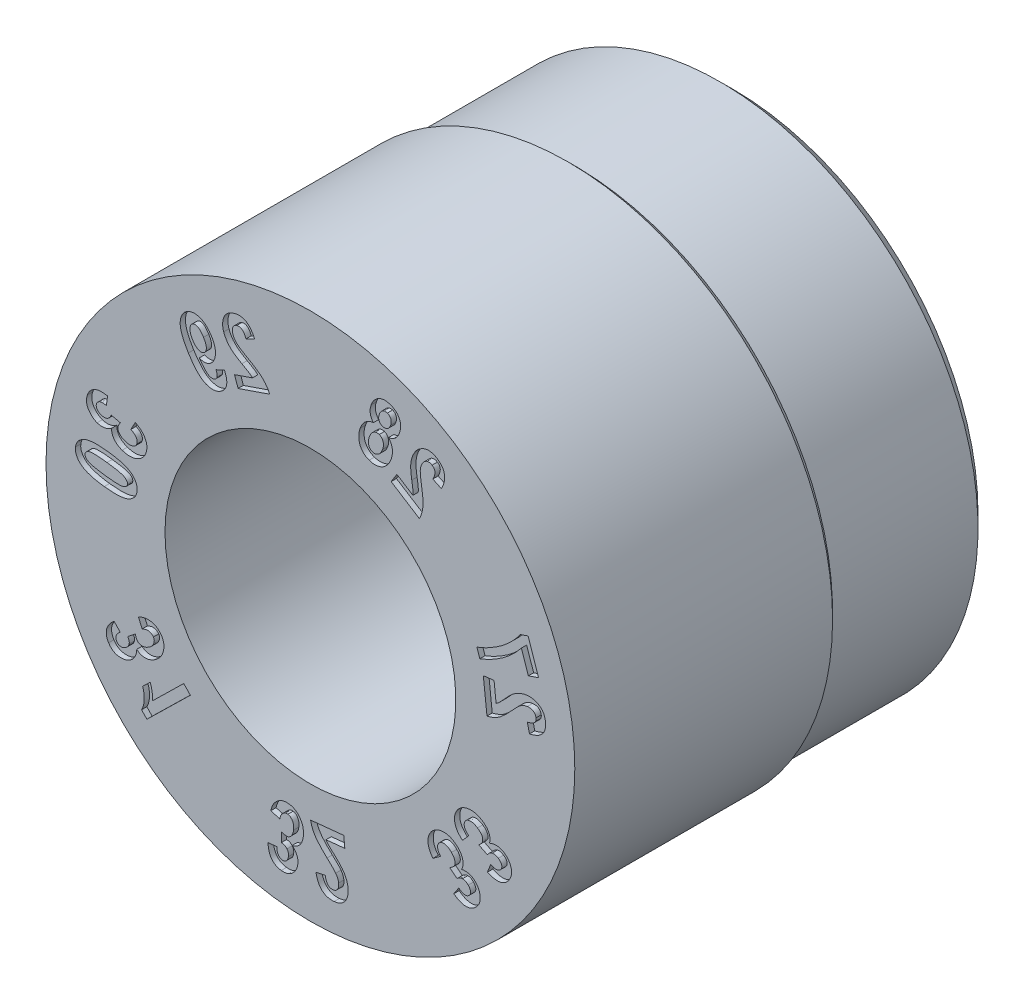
from build123d import *

# Parameters (mm, degrees)
CUT_EXTRUDE3_DEPTH = 0.2


with BuildPart() as part:
    # Sketch2 → Revolve1 (revolve)
    with BuildSketch(Plane(origin=(0, 0, 0), x_dir=(1, 0, 0), z_dir=(0, 1, 0)), mode=Mode.PRIVATE) as revolve1_sk:
        Polygon((9.249621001, 16), (2, 16), (2, 12), (5.5, 12), (5.5, 0), (10, 0), (10, 9.75), (9.75, 10), (9.75, 15.499621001), align=None)
    revolve(revolve1_sk.sketch.rotate(Axis((0, 0, -4.849143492), (0, 0, 1)), 180), axis=Axis((0, 0, -4.849143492), (0, 0, 1)))

    # Sketch9 → Cut-Extrude3 (cut)
    # profile 1 of 14: a face of its own
    with BuildSketch(Plane.XY):
        with BuildLine():
            Line((6.945865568, 1.365042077), (6.540235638, 1.320477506))
            Line((6.540235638, 1.320477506), (6.678180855, 0.065025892))
            add(Edge.make_bspline(
                [(6.678180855, 0.065025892), (6.715704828, 0.073454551), (6.790564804, 0.090269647), (6.898675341, 0.129366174), (7.003225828, 0.177097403), (7.087351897, 0.22610953), (7.154544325, 0.272765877), (7.209000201, 0.313824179), (7.266199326, 0.362047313), (7.327174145, 0.416399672), (7.390816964, 0.478076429), (7.458977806, 0.545092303), (7.529504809, 0.619702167), (7.577348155, 0.671840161), (7.602100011, 0.698813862)],
                knots=[0, 0, 0, 0, 1.210903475, 2.415741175, 3.614422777, 4.829304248, 5.477408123, 6.191639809, 6.977581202, 7.834306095, 8.765204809, 9.770030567, 10.846320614, 12, 12, 12, 12], degree=3))
            add(Edge.make_bspline(
                [(7.602100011, 0.698813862), (7.621493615, 0.719976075), (7.658507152, 0.760365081), (7.712090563, 0.817374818), (7.760531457, 0.86831873), (7.805043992, 0.912222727), (7.843539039, 0.950878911), (7.877680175, 0.982929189), (7.906968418, 1.008690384), (7.925657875, 1.022932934), (7.933981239, 1.029275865)],
                knots=[0, 0, 0, 0, 1.469359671, 2.804336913, 4.005076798, 5.067497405, 6.004650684, 6.797449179, 7.46444311, 8, 8, 8, 8], degree=3))
            add(Edge.make_bspline(
                [(7.933981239, 1.029275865), (7.955358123, 1.044197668), (7.997032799, 1.073288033), (8.064425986, 1.1061809), (8.132933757, 1.12967065), (8.179819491, 1.137046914), (8.202975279, 1.140689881)],
                knots=[0, 0, 0, 0, 1.061115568, 2.068666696, 3.046158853, 4, 4, 4, 4], degree=3))
            add(Edge.make_bspline(
                [(8.202975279, 1.140689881), (8.226488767, 1.142701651), (8.270832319, 1.146495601), (8.33392044, 1.140193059), (8.389204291, 1.125415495), (8.435969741, 1.100358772), (8.474169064, 1.067649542), (8.503006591, 1.027709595), (8.523161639, 0.981749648), (8.528419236, 0.948288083), (8.531121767, 0.931088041)],
                knots=[0, 0, 0, 0, 1.284830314, 2.42303217, 3.43989917, 4.386563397, 5.292301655, 6.158766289, 7.053562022, 8, 8, 8, 8], degree=3))
            add(Edge.make_bspline(
                [(8.531121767, 0.931088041), (8.532203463, 0.91222338), (8.534284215, 0.875935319), (8.523014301, 0.823182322), (8.498578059, 0.776618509), (8.462680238, 0.735711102), (8.414481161, 0.701237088), (8.354475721, 0.673642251), (8.283332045, 0.650090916), (8.231208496, 0.640471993), (8.203453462, 0.635350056)],
                knots=[0, 0, 0, 0, 0.913722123, 1.757635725, 2.579276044, 3.438933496, 4.37433614, 5.431505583, 6.632314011, 8, 8, 8, 8], degree=3))
            Line((8.203453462, 0.635350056), (8.286270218, 0.284828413))
            add(Edge.make_bspline(
                [(8.286270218, 0.284828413), (8.31395853, 0.290931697), (8.36773253, 0.302785), (8.444811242, 0.325419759), (8.515494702, 0.352114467), (8.580265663, 0.381350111), (8.638604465, 0.414314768), (8.690834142, 0.450457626), (8.736760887, 0.490310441), (8.776498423, 0.533492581), (8.810214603, 0.579832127), (8.838794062, 0.628761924), (8.861736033, 0.680576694), (8.878569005, 0.735325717), (8.891051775, 0.792508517), (8.897069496, 0.852635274), (8.897452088, 0.91555723), (8.893847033, 0.958166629), (8.891997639, 0.980025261)],
                knots=[0, 0, 0, 0, 1.316678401, 2.557146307, 3.727226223, 4.823655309, 5.854584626, 6.835260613, 7.768888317, 8.673026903, 9.554907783, 10.425565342, 11.300463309, 12.180346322, 13.081818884, 14.014614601, 14.981496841, 16, 16, 16, 16], degree=3))
            add(Edge.make_bspline(
                [(8.891997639, 0.980025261), (8.888757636, 1.003717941), (8.882472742, 1.049676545), (8.866609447, 1.115886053), (8.844542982, 1.176526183), (8.81757201, 1.232528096), (8.784348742, 1.28275039), (8.746072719, 1.328422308), (8.701630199, 1.368187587), (8.652545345, 1.402709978), (8.600390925, 1.432406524), (8.546377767, 1.45703509), (8.491167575, 1.476900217), (8.434879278, 1.492272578), (8.377263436, 1.50217599), (8.318487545, 1.508034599), (8.258453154, 1.508611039), (8.218218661, 1.50500781), (8.197940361, 1.503191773)],
                knots=[0, 0, 0, 0, 1.173652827, 2.276629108, 3.335023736, 4.336619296, 5.321091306, 6.283820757, 7.254537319, 8.239831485, 9.225125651, 10.197062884, 11.150738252, 12.103199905, 13.057936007, 14.017536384, 15.000832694, 16, 16, 16, 16], degree=3))
            add(Edge.make_bspline(
                [(8.197940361, 1.503191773), (8.174825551, 1.500196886), (8.128811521, 1.494235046), (8.061236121, 1.478908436), (7.995104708, 1.459528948), (7.93032393, 1.435803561), (7.866687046, 1.40666629), (7.803642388, 1.372641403), (7.7408576, 1.333355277), (7.68876188, 1.296518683), (7.646291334, 1.263324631), (7.61263581, 1.234079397), (7.576781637, 1.201608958), (7.539068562, 1.165425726), (7.499093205, 1.126320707), (7.457684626, 1.082975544), (7.413936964, 1.036467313), (7.384461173, 1.003853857), (7.369332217, 0.987114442)],
                knots=[0, 0, 0, 0, 1.116805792, 2.223195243, 3.31725657, 4.418851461, 5.527133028, 6.669491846, 7.850789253, 9.075422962, 9.72636706, 10.433968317, 11.212223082, 12.045064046, 12.93920453, 13.892729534, 14.918407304, 16, 16, 16, 16], degree=3))
            add(Edge.make_bspline(
                [(7.369332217, 0.987114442), (7.355318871, 0.971625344), (7.32862053, 0.94211539), (7.290381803, 0.900215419), (7.255349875, 0.863201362), (7.225242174, 0.829412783), (7.197406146, 0.801397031), (7.174401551, 0.776783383), (7.154368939, 0.757304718), (7.124551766, 0.728451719), (7.082959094, 0.692121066), (7.043022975, 0.666126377), (7.02383965, 0.653639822)],
                knots=[0, 0, 0, 0, 1.30077431, 2.478245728, 3.532467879, 4.474445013, 5.295791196, 5.991390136, 6.572169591, 7.035389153, 8.575948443, 10, 10, 10, 10], degree=3))
            Line((7.02383965, 0.653639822), (6.945865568, 1.365042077))
        make_face()
    # profile 2 of 14: a face of its own
    with BuildSketch(Plane.XY):
        with BuildLine():
            Line((8.243619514, 2.165271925), (8.630455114, 2.29708785))
            Line((8.630455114, 2.29708785), (8.232295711, 3.464897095))
            Line((8.232295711, 3.464897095), (7.929982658, 3.362042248))
            add(Edge.make_bspline(
                [(7.929982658, 3.362042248), (7.919024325, 3.344678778), (7.896501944, 3.308992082), (7.857931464, 3.256129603), (7.815880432, 3.201022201), (7.768360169, 3.144687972), (7.717231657, 3.086088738), (7.660910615, 3.026335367), (7.6003615, 2.96482991), (7.513435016, 2.88022429), (7.397935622, 2.776097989), (7.250450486, 2.657159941), (7.093913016, 2.545484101), (6.958086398, 2.457451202), (6.846647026, 2.392023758), (6.764455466, 2.344878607), (6.682824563, 2.30219585), (6.602898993, 2.261821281), (6.524095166, 2.224872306), (6.446424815, 2.191339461), (6.370193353, 2.160814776), (6.319266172, 2.14298061), (6.294206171, 2.13420486)],
                knots=[0, 0, 0, 0, 0.592925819, 1.218625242, 1.889308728, 2.594945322, 3.346961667, 4.135506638, 4.966343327, 5.83992233, 7.639133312, 9.456054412, 11.30963279, 13.191274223, 14.129172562, 15.042249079, 15.927901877, 16.789598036, 17.628694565, 18.441505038, 19.233103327, 20, 20, 20, 20], degree=3))
            Line((6.294206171, 2.13420486), (6.406284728, 1.805539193))
            add(Edge.make_bspline(
                [(6.406284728, 1.805539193), (6.444406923, 1.819888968), (6.52082518, 1.848653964), (6.633024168, 1.898096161), (6.74434407, 1.95030586), (6.853986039, 2.00694558), (6.961929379, 2.067846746), (7.069018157, 2.131926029), (7.173818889, 2.201223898), (7.277391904, 2.273465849), (7.378194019, 2.349099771), (7.475343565, 2.427388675), (7.569331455, 2.507323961), (7.658618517, 2.59018414), (7.744517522, 2.674910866), (7.826982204, 2.761246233), (7.904908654, 2.85041927), (7.954197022, 2.91161957), (7.978732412, 2.942084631)],
                knots=[0, 0, 0, 0, 0.995463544, 1.995467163, 2.995843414, 4.000594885, 5.010980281, 6.024906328, 7.050248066, 8.081250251, 9.111188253, 10.129832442, 11.130581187, 12.126361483, 13.106449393, 14.079395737, 15.043937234, 16, 16, 16, 16], degree=3))
            Line((7.978732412, 2.942084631), (8.243619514, 2.165271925))
        make_face()
    # profile 3 of 14: a face of its own
    with BuildSketch(Plane.XY):
        with BuildLine():
            Line((3.272430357, 6.277623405), (3.053641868, 5.932770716))
            Line((3.053641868, 5.932770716), (4.121366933, 5.255035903))
            add(Edge.make_bspline(
                [(4.121366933, 5.255035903), (4.138155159, 5.28968839), (4.171623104, 5.358769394), (4.209046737, 5.467675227), (4.237208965, 5.579249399), (4.251765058, 5.675697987), (4.257259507, 5.757386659), (4.259322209, 5.825603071), (4.256949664, 5.900650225), (4.252983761, 5.98230446), (4.245137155, 6.070761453), (4.234790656, 6.165839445), (4.221166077, 6.267687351), (4.210199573, 6.337638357), (4.2045443, 6.373711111)],
                knots=[0, 0, 0, 0, 1.211062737, 2.41429795, 3.616663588, 4.829618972, 5.477921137, 6.19310041, 6.976746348, 7.840490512, 8.766075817, 9.771362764, 10.850722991, 12, 12, 12, 12], degree=3))
            add(Edge.make_bspline(
                [(4.2045443, 6.373711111), (4.200210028, 6.402150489), (4.191948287, 6.456359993), (4.180508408, 6.533773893), (4.171419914, 6.603583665), (4.163896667, 6.665599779), (4.159235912, 6.720186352), (4.155147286, 6.766856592), (4.153744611, 6.806028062), (4.153999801, 6.829466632), (4.15411371, 6.839928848)],
                knots=[0, 0, 0, 0, 1.470827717, 2.803607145, 4.000784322, 5.070147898, 5.99709853, 6.801656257, 7.46509832, 8, 8, 8, 8], degree=3))
            add(Edge.make_bspline(
                [(4.15411371, 6.839928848), (4.155980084, 6.866001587), (4.15961564, 6.916789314), (4.175385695, 6.990108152), (4.200183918, 7.058283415), (4.223718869, 7.099568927), (4.235411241, 7.120079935)],
                knots=[0, 0, 0, 0, 1.062376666, 2.069429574, 3.04087547, 4, 4, 4, 4], degree=3))
            add(Edge.make_bspline(
                [(4.235411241, 7.120079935), (4.248563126, 7.139701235), (4.273335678, 7.176659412), (4.31766026, 7.221875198), (4.363464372, 7.256032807), (4.41215971, 7.276814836), (4.461393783, 7.286025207), (4.510495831, 7.284419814), (4.558856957, 7.270792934), (4.588395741, 7.254174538), (4.603636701, 7.245600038)],
                knots=[0, 0, 0, 0, 1.287180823, 2.424500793, 3.439639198, 4.387442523, 5.28795894, 6.154144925, 7.047604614, 8, 8, 8, 8], degree=3))
            add(Edge.make_bspline(
                [(4.603636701, 7.245600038), (4.619116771, 7.234624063), (4.648834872, 7.213552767), (4.683038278, 7.171652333), (4.704489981, 7.123552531), (4.713438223, 7.069678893), (4.710402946, 7.010565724), (4.695274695, 6.946051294), (4.66868053, 6.875950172), (4.643769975, 6.829122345), (4.630546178, 6.804263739)],
                knots=[0, 0, 0, 0, 0.916038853, 1.758579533, 2.584042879, 3.439513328, 4.379183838, 5.432730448, 6.637161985, 8, 8, 8, 8], degree=3))
            Line((4.630546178, 6.804263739), (4.956552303, 6.649533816))
            add(Edge.make_bspline(
                [(4.956552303, 6.649533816), (4.969126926, 6.675008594), (4.993543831, 6.724474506), (5.023786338, 6.798993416), (5.047741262, 6.870660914), (5.065030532, 6.939671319), (5.075654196, 7.005848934), (5.080075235, 7.069357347), (5.078055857, 7.130249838), (5.068656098, 7.18838076), (5.053253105, 7.243679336), (5.033274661, 7.296898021), (5.006783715, 7.347121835), (4.975045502, 7.395083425), (4.937090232, 7.439832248), (4.894344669, 7.482810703), (4.845581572, 7.522720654), (4.809942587, 7.54643127), (4.791731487, 7.558547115)],
                knots=[0, 0, 0, 0, 1.316834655, 2.556977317, 3.725381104, 4.81786255, 5.851690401, 6.828967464, 7.765385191, 8.67000505, 9.551991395, 10.423387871, 11.300301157, 12.178859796, 13.084676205, 14.016095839, 14.986248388, 16, 16, 16, 16], degree=3))
            add(Edge.make_bspline(
                [(4.791731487, 7.558547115), (4.771261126, 7.570983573), (4.731519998, 7.595127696), (4.669556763, 7.62309387), (4.608412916, 7.644325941), (4.547738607, 7.65816031), (4.487495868, 7.663291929), (4.427977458, 7.662046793), (4.368942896, 7.652820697), (4.311247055, 7.635533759), (4.255792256, 7.61269406), (4.202652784, 7.586242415), (4.15240317, 7.556032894), (4.1052701, 7.521435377), (4.061136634, 7.482632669), (4.020313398, 7.43964096), (3.98227375, 7.392977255), (3.959797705, 7.359437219), (3.948433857, 7.342479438)],
                knots=[0, 0, 0, 0, 1.173167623, 2.27758597, 3.324660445, 4.342219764, 5.31890153, 6.281042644, 7.254146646, 8.237827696, 9.226332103, 10.190896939, 11.145125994, 12.096662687, 13.053064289, 14.021774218, 14.999812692, 16, 16, 16, 16], degree=3))
            add(Edge.make_bspline(
                [(3.948433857, 7.342479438), (3.936395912, 7.322538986), (3.912439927, 7.282856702), (3.881344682, 7.220872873), (3.855448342, 7.157013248), (3.833330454, 7.091546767), (3.816634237, 7.023527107), (3.803181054, 6.952904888), (3.795094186, 6.879157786), (3.791690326, 6.815380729), (3.791068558, 6.76143909), (3.79275912, 6.716839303), (3.795479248, 6.668523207), (3.799874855, 6.616491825), (3.806246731, 6.560804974), (3.813598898, 6.501191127), (3.823096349, 6.437899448), (3.829934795, 6.39447408), (3.833449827, 6.372152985)],
                knots=[0, 0, 0, 0, 1.115100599, 2.219094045, 3.316289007, 4.412781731, 5.524918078, 6.66741051, 7.853077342, 9.074334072, 9.72457179, 10.435557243, 11.211018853, 12.041831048, 12.935524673, 13.894892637, 14.917952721, 16, 16, 16, 16], degree=3))
            add(Edge.make_bspline(
                [(3.833449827, 6.372152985), (3.836843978, 6.351643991), (3.843326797, 6.312471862), (3.851458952, 6.256393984), (3.859334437, 6.206088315), (3.866131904, 6.161420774), (3.871147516, 6.122101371), (3.875174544, 6.088448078), (3.878840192, 6.060506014), (3.881873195, 6.018960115), (3.883912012, 5.963767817), (3.879471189, 5.916287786), (3.877350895, 5.893618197)],
                knots=[0, 0, 0, 0, 1.293559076, 2.470694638, 3.52597182, 4.462140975, 5.282131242, 5.992345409, 6.571484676, 7.035156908, 8.584420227, 10, 10, 10, 10], degree=3))
            Line((3.877350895, 5.893618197), (3.272430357, 6.277623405))
        make_face()
    # profile 4 of 14: a face of its own
    with BuildSketch(Plane.XY):
        with BuildLine():
            add(Edge.make_bspline(
                [(2.952462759, 7.323372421), (2.97657633, 7.327647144), (3.023712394, 7.336003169), (3.090638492, 7.359670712), (3.151814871, 7.391781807), (3.207543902, 7.432474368), (3.256805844, 7.482454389), (3.300396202, 7.540681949), (3.337990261, 7.607548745), (3.35687665, 7.656468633), (3.366627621, 7.681725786)],
                knots=[0, 0, 0, 0, 1.014069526, 1.982254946, 2.929334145, 3.870186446, 4.831359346, 5.827867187, 6.878536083, 8, 8, 8, 8], degree=3))
            add(Edge.make_bspline(
                [(3.366627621, 7.681725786), (3.373733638, 7.702740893), (3.387587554, 7.743712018), (3.402335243, 7.805497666), (3.410609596, 7.865824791), (3.414322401, 7.924435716), (3.411309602, 7.98147026), (3.403244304, 8.03668867), (3.388992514, 8.09031071), (3.369305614, 8.142021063), (3.3439979, 8.19105399), (3.314234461, 8.237086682), (3.278981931, 8.279190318), (3.239485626, 8.318196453), (3.194133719, 8.352543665), (3.144704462, 8.383865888), (3.090047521, 8.411134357), (3.051406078, 8.426142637), (3.031580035, 8.433843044)],
                knots=[0, 0, 0, 0, 1.144058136, 2.230459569, 3.270650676, 4.282336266, 5.25525161, 6.211518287, 7.15623007, 8.111695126, 9.060218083, 9.99787411, 10.933484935, 11.887746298, 12.855165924, 13.862170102, 14.903128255, 16, 16, 16, 16], degree=3))
            add(Edge.make_bspline(
                [(3.031580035, 8.433843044), (3.010369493, 8.44102909), (2.96900037, 8.455044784), (2.906534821, 8.4682751), (2.846178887, 8.475650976), (2.787878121, 8.47689249), (2.731513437, 8.471303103), (2.677414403, 8.458494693), (2.625011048, 8.440227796), (2.575621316, 8.41448902), (2.528560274, 8.384851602), (2.48539369, 8.350276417), (2.445128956, 8.312807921), (2.408613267, 8.271322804), (2.375494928, 8.226048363), (2.346140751, 8.176831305), (2.319243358, 8.124403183), (2.305318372, 8.087168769), (2.298243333, 8.068250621)],
                knots=[0, 0, 0, 0, 1.162008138, 2.266385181, 3.308309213, 4.315730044, 5.288288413, 6.240648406, 7.196568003, 8.161882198, 9.125888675, 10.080318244, 11.029071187, 11.978710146, 12.945531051, 13.937420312, 14.952039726, 16, 16, 16, 16], degree=3))
            add(Edge.make_bspline(
                [(2.298243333, 8.068250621), (2.289728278, 8.042368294), (2.273181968, 7.992074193), (2.260159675, 7.915358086), (2.256565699, 7.841133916), (2.263945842, 7.76960206), (2.280189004, 7.701828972), (2.305420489, 7.638439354), (2.338536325, 7.579405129), (2.367404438, 7.544951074), (2.381889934, 7.527662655)],
                knots=[0, 0, 0, 0, 1.134675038, 2.204881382, 3.233047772, 4.22403168, 5.192774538, 6.129315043, 7.061324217, 8, 8, 8, 8], degree=3))
            add(Edge.make_bspline(
                [(2.381889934, 7.527662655), (2.353043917, 7.523423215), (2.296738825, 7.515148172), (2.21649258, 7.488957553), (2.143434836, 7.451364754), (2.077529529, 7.402339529), (2.01863702, 7.342455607), (1.966804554, 7.271413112), (1.920954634, 7.189687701), (1.897763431, 7.129547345), (1.88574505, 7.098380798)],
                knots=[0, 0, 0, 0, 1.00393448, 1.959598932, 2.895127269, 3.825197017, 4.779711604, 5.779888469, 6.849471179, 8, 8, 8, 8], degree=3))
            add(Edge.make_bspline(
                [(1.88574505, 7.098380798), (1.874888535, 7.065370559), (1.853780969, 7.001191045), (1.835025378, 6.903613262), (1.827295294, 6.808766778), (1.831022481, 6.716981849), (1.845750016, 6.629676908), (1.871600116, 6.548256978), (1.907072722, 6.472883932), (1.95370262, 6.405058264), (2.009127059, 6.344854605), (2.072649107, 6.292978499), (2.144359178, 6.250308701), (2.196323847, 6.229380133), (2.222818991, 6.218709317)],
                knots=[0, 0, 0, 0, 1.182328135, 2.298718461, 3.37425061, 4.416346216, 5.418691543, 6.37991871, 7.316755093, 8.244879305, 9.171353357, 10.094427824, 11.028408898, 12, 12, 12, 12], degree=3))
            add(Edge.make_bspline(
                [(2.222818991, 6.218709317), (2.244024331, 6.211795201), (2.28565864, 6.198220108), (2.349140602, 6.184634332), (2.411876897, 6.178111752), (2.473916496, 6.178174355), (2.535166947, 6.183961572), (2.595326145, 6.197992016), (2.655082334, 6.216912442), (2.713203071, 6.243601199), (2.769451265, 6.275657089), (2.821784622, 6.314424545), (2.870384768, 6.358692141), (2.915270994, 6.408663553), (2.955778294, 6.464791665), (2.992482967, 6.526365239), (3.025594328, 6.593566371), (3.043915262, 6.641177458), (3.053313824, 6.665601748)],
                knots=[0, 0, 0, 0, 1.009359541, 1.981764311, 2.932920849, 3.859614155, 4.786970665, 5.711458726, 6.651144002, 7.620306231, 8.601196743, 9.5775388, 10.562407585, 11.573179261, 12.613044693, 13.691180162, 14.815585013, 16, 16, 16, 16], degree=3))
            add(Edge.make_bspline(
                [(3.053313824, 6.665601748), (3.06378794, 6.697350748), (3.084113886, 6.758962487), (3.100866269, 6.852279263), (3.105962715, 6.942275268), (3.098649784, 7.028674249), (3.080143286, 7.111081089), (3.049257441, 7.188082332), (3.007226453, 7.260012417), (2.970889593, 7.30205311), (2.952462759, 7.323372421)],
                knots=[0, 0, 0, 0, 1.141342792, 2.214876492, 3.229115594, 4.213592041, 5.168595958, 6.104349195, 7.038694, 8, 8, 8, 8], degree=3))
        make_face()
        with BuildLine():
            add(Edge.make_bspline(
                [(3.033231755, 7.767528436), (3.025539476, 7.747596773), (3.010970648, 7.709847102), (2.98013434, 7.660820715), (2.945196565, 7.621062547), (2.904978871, 7.592212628), (2.861841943, 7.573569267), (2.817150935, 7.565359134), (2.771402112, 7.566190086), (2.742106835, 7.575103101), (2.727129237, 7.579659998)],
                knots=[0, 0, 0, 0, 1.266407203, 2.398518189, 3.420843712, 4.391649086, 5.313430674, 6.188717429, 7.073957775, 8, 8, 8, 8], degree=3))
            add(Edge.make_bspline(
                [(2.727129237, 7.579659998), (2.712505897, 7.585821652), (2.683835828, 7.597902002), (2.647083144, 7.626085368), (2.617377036, 7.661115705), (2.595570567, 7.70302747), (2.582180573, 7.751125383), (2.580060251, 7.804339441), (2.587802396, 7.861853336), (2.600069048, 7.900299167), (2.606552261, 7.920618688)],
                knots=[0, 0, 0, 0, 0.933048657, 1.829306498, 2.702201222, 3.623723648, 4.59466367, 5.623030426, 6.743716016, 8, 8, 8, 8], degree=3))
            add(Edge.make_bspline(
                [(2.606552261, 7.920618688), (2.614121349, 7.939864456), (2.628504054, 7.97643507), (2.658834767, 8.024210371), (2.693661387, 8.063154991), (2.734118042, 8.091001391), (2.776638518, 8.110164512), (2.820931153, 8.118777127), (2.86620207, 8.117644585), (2.895193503, 8.109025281), (2.910056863, 8.104606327)],
                knots=[0, 0, 0, 0, 1.243881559, 2.363611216, 3.392055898, 4.37051614, 5.301554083, 6.183708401, 7.068821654, 8, 8, 8, 8], degree=3))
            add(Edge.make_bspline(
                [(2.910056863, 8.104606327), (2.925033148, 8.098401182), (2.95409379, 8.086360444), (2.99141851, 8.057772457), (3.021119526, 8.022195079), (3.042695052, 7.979846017), (3.055459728, 7.932180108), (3.05854943, 7.880116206), (3.05127992, 7.824255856), (3.039444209, 7.78705488), (3.033231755, 7.767528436)],
                knots=[0, 0, 0, 0, 0.961170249, 1.865097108, 2.765257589, 3.698268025, 4.669984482, 5.680605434, 6.782571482, 8, 8, 8, 8], degree=3))
        make_face(mode=Mode.SUBTRACT)
        with BuildLine():
            add(Edge.make_bspline(
                [(2.730897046, 6.826072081), (2.725545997, 6.812070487), (2.715097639, 6.784731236), (2.697695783, 6.745722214), (2.678016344, 6.710496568), (2.657770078, 6.678152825), (2.635811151, 6.649287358), (2.61233808, 6.623669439), (2.587443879, 6.601368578), (2.553147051, 6.577015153), (2.508984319, 6.554606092), (2.454831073, 6.53880399), (2.400180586, 6.537225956), (2.365894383, 6.546819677), (2.348606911, 6.551656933)],
                knots=[0, 0, 0, 0, 1.029803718, 2.010775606, 2.931232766, 3.799780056, 4.630470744, 5.419129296, 6.183726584, 6.92202457, 8.304052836, 9.564715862, 10.77210362, 12, 12, 12, 12], degree=3))
            add(Edge.make_bspline(
                [(2.348606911, 6.551656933), (2.332202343, 6.558803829), (2.299960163, 6.572850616), (2.259376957, 6.607689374), (2.22720968, 6.651619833), (2.208611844, 6.695407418), (2.198329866, 6.734424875), (2.193736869, 6.766634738), (2.192071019, 6.800758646), (2.194159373, 6.836812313), (2.199167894, 6.874996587), (2.207178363, 6.915396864), (2.218655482, 6.957704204), (2.22845048, 6.986144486), (2.233481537, 7.000752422)],
                knots=[0, 0, 0, 0, 1.236170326, 2.429617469, 3.660399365, 4.987482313, 5.703637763, 6.457229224, 7.241192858, 8.071207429, 8.960129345, 9.912579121, 10.927826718, 12, 12, 12, 12], degree=3))
            add(Edge.make_bspline(
                [(2.233481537, 7.000752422), (2.243147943, 7.025064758), (2.261615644, 7.071513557), (2.298896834, 7.133243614), (2.342275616, 7.183928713), (2.391926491, 7.221718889), (2.443898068, 7.248309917), (2.497432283, 7.26226421), (2.551611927, 7.263308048), (2.585876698, 7.253275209), (2.603178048, 7.248209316)],
                knots=[0, 0, 0, 0, 1.26453011, 2.415888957, 3.473336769, 4.47350981, 5.416594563, 6.280268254, 7.13165391, 8, 8, 8, 8], degree=3))
            add(Edge.make_bspline(
                [(2.603178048, 7.248209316), (2.619579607, 7.241059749), (2.651815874, 7.227007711), (2.692703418, 7.191984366), (2.725007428, 7.147258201), (2.747841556, 7.093190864), (2.761691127, 7.032672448), (2.763510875, 6.966777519), (2.753849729, 6.896784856), (2.738771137, 6.850330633), (2.730897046, 6.826072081)],
                knots=[0, 0, 0, 0, 0.871052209, 1.712000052, 2.595807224, 3.547859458, 4.563129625, 5.615047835, 6.754569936, 8, 8, 8, 8], degree=3))
        make_face(mode=Mode.SUBTRACT)
    # profile 5 of 14: a face of its own
    with BuildSketch(Plane.XY):
        with BuildLine():
            Line((-2.86864015, 6.474133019), (-2.735520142, 6.087584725))
            Line((-2.735520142, 6.087584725), (-1.53864459, 6.498909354))
            add(Edge.make_bspline(
                [(-1.53864459, 6.498909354), (-1.555249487, 6.533729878), (-1.588292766, 6.603021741), (-1.649691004, 6.700522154), (-1.71922645, 6.792257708), (-1.785561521, 6.863775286), (-1.845559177, 6.919594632), (-1.898142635, 6.963319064), (-1.958077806, 7.008593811), (-2.024728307, 7.05632576), (-2.098746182, 7.105548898), (-2.179669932, 7.157012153), (-2.267679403, 7.210220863), (-2.329328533, 7.24531569), (-2.361151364, 7.263431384)],
                knots=[0, 0, 0, 0, 1.2119574, 2.411761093, 3.614693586, 4.826729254, 5.472819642, 6.190138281, 6.975628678, 7.833890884, 8.767117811, 9.769838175, 10.84880673, 12, 12, 12, 12], degree=3))
            add(Edge.make_bspline(
                [(-2.361151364, 7.263431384), (-2.386123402, 7.277706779), (-2.433794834, 7.3049584), (-2.501273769, 7.344677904), (-2.561639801, 7.381111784), (-2.615000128, 7.413733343), (-2.660794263, 7.443802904), (-2.699503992, 7.469900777), (-2.731338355, 7.492489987), (-2.749278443, 7.507491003), (-2.757323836, 7.514218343)],
                knots=[0, 0, 0, 0, 1.470835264, 2.807813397, 4.003711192, 5.076294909, 6.005567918, 6.80460163, 7.463912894, 8, 8, 8, 8], degree=3))
            add(Edge.make_bspline(
                [(-2.757323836, 7.514218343), (-2.776714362, 7.531806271), (-2.814610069, 7.566179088), (-2.861070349, 7.625291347), (-2.899641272, 7.686882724), (-2.91693518, 7.731141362), (-2.9255265, 7.753128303)],
                knots=[0, 0, 0, 0, 1.061324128, 2.074189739, 3.043290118, 4, 4, 4, 4], degree=3))
            add(Edge.make_bspline(
                [(-2.9255265, 7.753128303), (-2.932527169, 7.775706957), (-2.94570194, 7.818198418), (-2.954700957, 7.881142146), (-2.951673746, 7.938419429), (-2.937904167, 7.989611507), (-2.914201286, 8.03402165), (-2.882049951, 8.071267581), (-2.841092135, 8.100784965), (-2.80959049, 8.113354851), (-2.793248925, 8.119875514)],
                knots=[0, 0, 0, 0, 1.285688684, 2.419576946, 3.441336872, 4.387501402, 5.282251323, 6.158774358, 7.044859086, 8, 8, 8, 8], degree=3))
            add(Edge.make_bspline(
                [(-2.793248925, 8.119875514), (-2.774994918, 8.125134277), (-2.739912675, 8.135241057), (-2.685813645, 8.13532282), (-2.634741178, 8.122284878), (-2.587220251, 8.095335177), (-2.542721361, 8.056317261), (-2.502520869, 8.00373156), (-2.464062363, 7.939436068), (-2.443397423, 7.890523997), (-2.432404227, 7.864504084)],
                knots=[0, 0, 0, 0, 0.91627616, 1.760984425, 2.58464923, 3.441525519, 4.381534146, 5.431685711, 6.633725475, 8, 8, 8, 8], degree=3))
            Line((-2.432404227, 7.864504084), (-2.107604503, 8.023113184))
            add(Edge.make_bspline(
                [(-2.107604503, 8.023113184), (-2.119661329, 8.048978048), (-2.142976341, 8.098994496), (-2.182431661, 8.169085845), (-2.223498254, 8.232519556), (-2.266275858, 8.289429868), (-2.311605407, 8.339065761), (-2.35844222, 8.382149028), (-2.407512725, 8.418319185), (-2.45827387, 8.448077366), (-2.511194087, 8.470651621), (-2.565388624, 8.487858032), (-2.621154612, 8.498687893), (-2.678494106, 8.503207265), (-2.73723096, 8.502329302), (-2.797387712, 8.494589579), (-2.859238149, 8.482432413), (-2.900010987, 8.469164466), (-2.920872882, 8.462375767)],
                knots=[0, 0, 0, 0, 1.321705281, 2.555861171, 3.722754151, 4.820821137, 5.850063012, 6.832822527, 7.764359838, 8.669199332, 9.552350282, 10.424233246, 11.299152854, 12.177743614, 13.084828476, 14.015259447, 14.984484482, 16, 16, 16, 16], degree=3))
            add(Edge.make_bspline(
                [(-2.920872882, 8.462375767), (-2.943303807, 8.454044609), (-2.986932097, 8.437840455), (-3.047946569, 8.40749486), (-3.102538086, 8.372621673), (-3.151222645, 8.333837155), (-3.193128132, 8.290386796), (-3.22897431, 8.242839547), (-3.258229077, 8.190847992), (-3.28103686, 8.135184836), (-3.298050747, 8.077563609), (-3.310848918, 8.019467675), (-3.317568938, 7.961076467), (-3.321171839, 7.902691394), (-3.3173438, 7.844157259), (-3.310444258, 7.785304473), (-3.297307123, 7.726429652), (-3.28512633, 7.687750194), (-3.278981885, 7.668238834)],
                knots=[0, 0, 0, 0, 1.171635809, 2.278839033, 3.330648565, 4.339994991, 5.320843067, 6.279874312, 7.249415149, 8.234860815, 9.220189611, 10.189819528, 11.144910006, 12.097192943, 13.050805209, 14.013820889, 14.998097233, 16, 16, 16, 16], degree=3))
            add(Edge.make_bspline(
                [(-3.278981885, 7.668238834), (-3.270923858, 7.646344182), (-3.254895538, 7.602793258), (-3.225689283, 7.539703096), (-3.192162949, 7.479370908), (-3.154094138, 7.421593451), (-3.111696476, 7.365877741), (-3.064583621, 7.311447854), (-3.012074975, 7.258988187), (-2.964606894, 7.216030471), (-2.922543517, 7.182319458), (-2.887230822, 7.155104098), (-2.847664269, 7.127315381), (-2.804212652, 7.098167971), (-2.757138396, 7.067706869), (-2.705551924, 7.037238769), (-2.650886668, 7.004274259), (-2.612528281, 6.982865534), (-2.592758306, 6.971831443)],
                knots=[0, 0, 0, 0, 1.116400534, 2.22064614, 3.323820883, 4.417360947, 5.529617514, 6.672972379, 7.860246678, 9.080470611, 9.735123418, 10.440075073, 11.214159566, 12.048862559, 12.944623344, 13.897479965, 14.916357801, 16, 16, 16, 16], degree=3))
            add(Edge.make_bspline(
                [(-2.592758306, 6.971831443), (-2.57447565, 6.961559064), (-2.539717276, 6.942029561), (-2.490419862, 6.913620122), (-2.446212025, 6.888020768), (-2.407148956, 6.865018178), (-2.373075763, 6.844879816), (-2.34404615, 6.82760255), (-2.32039473, 6.812366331), (-2.285808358, 6.789107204), (-2.241380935, 6.756019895), (-2.206910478, 6.722920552), (-2.190366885, 6.707035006)],
                knots=[0, 0, 0, 0, 1.301863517, 2.475059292, 3.532167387, 4.473213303, 5.289274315, 5.989332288, 6.570207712, 7.035468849, 8.577216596, 10, 10, 10, 10], degree=3))
            Line((-2.190366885, 6.707035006), (-2.86864015, 6.474133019))
        make_face()
    # profile 6 of 14: a face of its own
    with BuildSketch(Plane.XY):
        with BuildLine():
            Line((-3.249468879, 6.428957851), (-3.571596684, 6.285273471))
            add(Edge.make_bspline(
                [(-3.571596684, 6.285273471), (-3.563212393, 6.266848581), (-3.547427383, 6.232160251), (-3.531150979, 6.180555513), (-3.523044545, 6.133063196), (-3.523405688, 6.089431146), (-3.532378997, 6.049863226), (-3.550112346, 6.014736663), (-3.576267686, 5.983954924), (-3.598720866, 5.968427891), (-3.610384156, 5.960362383)],
                knots=[0, 0, 0, 0, 1.333585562, 2.510726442, 3.55652812, 4.497356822, 5.369155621, 6.206484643, 7.06835957, 8, 8, 8, 8], degree=3))
            add(Edge.make_bspline(
                [(-3.610384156, 5.960362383), (-3.618995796, 5.955476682), (-3.636006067, 5.945826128), (-3.663660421, 5.936150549), (-3.692093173, 5.930691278), (-3.721373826, 5.928853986), (-3.751414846, 5.932374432), (-3.782580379, 5.938840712), (-3.814222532, 5.950751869), (-3.847843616, 5.965570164), (-3.882965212, 5.987396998), (-3.920568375, 6.016486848), (-3.960536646, 6.053806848), (-4.00374121, 6.098498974), (-4.049290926, 6.151611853), (-4.098239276, 6.212014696), (-4.149960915, 6.280482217), (-4.184460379, 6.329316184), (-4.2025311, 6.354895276)],
                knots=[0, 0, 0, 0, 0.609114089, 1.203161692, 1.794981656, 2.389259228, 3.002546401, 3.653026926, 4.345560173, 5.081024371, 5.914056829, 6.885555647, 8.006465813, 9.28025566, 10.71411721, 12.316015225, 14.070339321, 16, 16, 16, 16], degree=3))
            add(Edge.make_bspline(
                [(-4.2025311, 6.354895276), (-4.184886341, 6.347787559), (-4.15062799, 6.333987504), (-4.098207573, 6.320491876), (-4.047229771, 6.312292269), (-3.99728473, 6.310546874), (-3.948741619, 6.315514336), (-3.901273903, 6.326386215), (-3.855218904, 6.344519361), (-3.826118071, 6.360843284), (-3.811376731, 6.369112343)],
                knots=[0, 0, 0, 0, 1.117890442, 2.170450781, 3.176059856, 4.150346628, 5.100737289, 6.038686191, 7.006475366, 8, 8, 8, 8], degree=3))
            add(Edge.make_bspline(
                [(-3.811376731, 6.369112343), (-3.796570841, 6.378933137), (-3.767239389, 6.398388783), (-3.728629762, 6.434310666), (-3.694097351, 6.474100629), (-3.66489123, 6.519233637), (-3.640070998, 6.568651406), (-3.61976489, 6.622620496), (-3.604578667, 6.681311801), (-3.594182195, 6.743997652), (-3.58903823, 6.809568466), (-3.590761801, 6.876702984), (-3.599465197, 6.944685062), (-3.614702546, 7.013418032), (-3.635879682, 7.083153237), (-3.664246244, 7.153613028), (-3.699138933, 7.224910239), (-3.726761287, 7.271389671), (-3.740878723, 7.295144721)],
                knots=[0, 0, 0, 0, 0.827180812, 1.638700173, 2.4497373, 3.278430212, 4.137899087, 5.024023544, 5.961771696, 6.960061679, 7.983431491, 9.023887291, 10.08555957, 11.174063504, 12.303005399, 13.479795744, 14.711955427, 16, 16, 16, 16], degree=3))
            add(Edge.make_bspline(
                [(-3.740878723, 7.295144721), (-3.756706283, 7.320046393), (-3.787591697, 7.36863875), (-3.839128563, 7.435391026), (-3.891890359, 7.495874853), (-3.947475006, 7.548619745), (-4.004125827, 7.595700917), (-4.064049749, 7.634428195), (-4.125675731, 7.666722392), (-4.188885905, 7.691802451), (-4.252456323, 7.709779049), (-4.315272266, 7.72120639), (-4.376933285, 7.725653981), (-4.4374, 7.723177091), (-4.496641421, 7.713715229), (-4.554549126, 7.697421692), (-4.611113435, 7.673865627), (-4.64686319, 7.65345547), (-4.665048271, 7.643073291)],
                knots=[0, 0, 0, 0, 1.28116736, 2.50003059, 3.659610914, 4.764339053, 5.825563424, 6.854751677, 7.857466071, 8.843789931, 9.803212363, 10.722949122, 11.6127333, 12.483303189, 13.346114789, 14.212931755, 15.09095937, 16, 16, 16, 16], degree=3))
            add(Edge.make_bspline(
                [(-4.665048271, 7.643073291), (-4.684471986, 7.630072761), (-4.722700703, 7.604485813), (-4.773812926, 7.558614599), (-4.817077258, 7.506611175), (-4.853374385, 7.449307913), (-4.881996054, 7.386498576), (-4.904332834, 7.318549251), (-4.918478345, 7.244712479), (-4.926055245, 7.165363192), (-4.92542308, 7.079798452), (-4.912059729, 6.988322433), (-4.888773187, 6.89067264), (-4.855950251, 6.786380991), (-4.810363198, 6.676564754), (-4.75558728, 6.559862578), (-4.690049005, 6.436744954), (-4.640056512, 6.354220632), (-4.614138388, 6.311436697)],
                knots=[0, 0, 0, 0, 0.753189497, 1.482387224, 2.205829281, 2.928615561, 3.663421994, 4.426487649, 5.23008098, 6.082665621, 6.994312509, 7.982331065, 9.056937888, 10.229832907, 11.504377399, 12.888536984, 14.386892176, 16, 16, 16, 16], degree=3))
            add(Edge.make_bspline(
                [(-4.614138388, 6.311436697), (-4.586895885, 6.268273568), (-4.534389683, 6.185082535), (-4.451927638, 6.069210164), (-4.371027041, 5.965360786), (-4.290311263, 5.874273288), (-4.209938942, 5.796195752), (-4.130844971, 5.72998674), (-4.05192591, 5.676809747), (-3.973442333, 5.636121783), (-3.896219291, 5.606603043), (-3.820560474, 5.586766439), (-3.746491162, 5.575930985), (-3.673701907, 5.57417371), (-3.602384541, 5.582580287), (-3.532574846, 5.599587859), (-3.464174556, 5.626229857), (-3.421350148, 5.650697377), (-3.399500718, 5.663180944)],
                knots=[0, 0, 0, 0, 1.589043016, 3.062663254, 4.426310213, 5.686482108, 6.848891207, 7.912458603, 8.894168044, 9.805794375, 10.659096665, 11.463189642, 12.236474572, 12.985057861, 13.723488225, 14.46583035, 15.217251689, 16, 16, 16, 16], degree=3))
            add(Edge.make_bspline(
                [(-3.399500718, 5.663180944), (-3.384849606, 5.672611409), (-3.356074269, 5.691133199), (-3.317295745, 5.723456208), (-3.281838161, 5.757207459), (-3.252037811, 5.794755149), (-3.224916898, 5.83377232), (-3.203505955, 5.876233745), (-3.185581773, 5.920736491), (-3.17248159, 5.967812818), (-3.163563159, 6.017371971), (-3.16052091, 6.069432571), (-3.162609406, 6.123817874), (-3.16953727, 6.180436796), (-3.181917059, 6.239317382), (-3.19910014, 6.30068069), (-3.221512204, 6.364493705), (-3.239981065, 6.40708029), (-3.249468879, 6.428957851)],
                knots=[0, 0, 0, 0, 0.965387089, 1.896056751, 2.795270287, 3.674860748, 4.549655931, 5.42592614, 6.305558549, 7.206903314, 8.130928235, 9.0930994, 10.092699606, 11.14579472, 12.252632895, 13.426262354, 14.677820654, 16, 16, 16, 16], degree=3))
        make_face()
        with BuildLine():
            add(Edge.make_bspline(
                [(-4.451366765, 6.818443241), (-4.460328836, 6.833560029), (-4.477666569, 6.862804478), (-4.500675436, 6.906806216), (-4.519672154, 6.949541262), (-4.534858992, 6.991011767), (-4.546163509, 7.031268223), (-4.553452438, 7.070164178), (-4.557494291, 7.107805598), (-4.556589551, 7.143859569), (-4.553546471, 7.177753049), (-4.548041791, 7.209228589), (-4.539134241, 7.237629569), (-4.529018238, 7.263871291), (-4.515635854, 7.287288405), (-4.49960489, 7.307730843), (-4.481150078, 7.325621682), (-4.46722858, 7.335240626), (-4.460208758, 7.340090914)],
                knots=[0, 0, 0, 0, 1.46795059, 2.839849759, 4.145458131, 5.372112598, 6.526326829, 7.634051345, 8.675149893, 9.68215569, 10.640949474, 11.517256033, 12.344818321, 13.123918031, 13.862527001, 14.588329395, 15.28817457, 16, 16, 16, 16], degree=3))
            add(Edge.make_bspline(
                [(-4.460208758, 7.340090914), (-4.445879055, 7.347567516), (-4.417447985, 7.362401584), (-4.368700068, 7.370582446), (-4.317810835, 7.364960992), (-4.27461944, 7.350994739), (-4.23972176, 7.332658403), (-4.212493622, 7.314050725), (-4.184924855, 7.291112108), (-4.156813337, 7.263907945), (-4.128839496, 7.23180255), (-4.100319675, 7.195621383), (-4.071552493, 7.154860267), (-4.053178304, 7.125682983), (-4.043593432, 7.110462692)],
                knots=[0, 0, 0, 0, 1.091767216, 2.166137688, 3.294490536, 4.538906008, 5.222289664, 5.964211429, 6.772637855, 7.653733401, 8.616115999, 9.6601782, 10.779435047, 12, 12, 12, 12], degree=3))
            add(Edge.make_bspline(
                [(-4.043593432, 7.110462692), (-4.034401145, 7.095079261), (-4.016607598, 7.065301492), (-3.993495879, 7.020683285), (-3.973132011, 6.978514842), (-3.957817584, 6.937753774), (-3.945742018, 6.899143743), (-3.938276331, 6.862401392), (-3.933828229, 6.827706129), (-3.933768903, 6.785319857), (-3.941303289, 6.736833), (-3.960788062, 6.685398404), (-3.99094572, 6.64183007), (-4.018925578, 6.621911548), (-4.033020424, 6.611877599)],
                knots=[0, 0, 0, 0, 1.162358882, 2.249982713, 3.25919515, 4.198165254, 5.072472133, 5.880754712, 6.627737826, 7.337847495, 8.625008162, 9.785976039, 10.884686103, 12, 12, 12, 12], degree=3))
            add(Edge.make_bspline(
                [(-4.033020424, 6.611877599), (-4.047762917, 6.604243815), (-4.077128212, 6.589038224), (-4.127572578, 6.58073707), (-4.18056698, 6.586402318), (-4.22571019, 6.600504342), (-4.262632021, 6.617535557), (-4.290801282, 6.635053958), (-4.318392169, 6.656496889), (-4.346092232, 6.681195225), (-4.372760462, 6.710269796), (-4.399779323, 6.742457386), (-4.426292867, 6.778803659), (-4.442830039, 6.804947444), (-4.451366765, 6.818443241)],
                knots=[0, 0, 0, 0, 1.14720089, 2.285087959, 3.487378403, 4.818772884, 5.550422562, 6.30602628, 7.116006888, 7.974380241, 8.879455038, 9.852461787, 10.891409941, 12, 12, 12, 12], degree=3))
        make_face(mode=Mode.SUBTRACT)
    # profile 7 of 14: a face of its own
    with BuildSketch(Plane.XY):
        with BuildLine():
            Line((-6.624363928, 3.029822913), (-6.791357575, 2.716797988))
            add(Edge.make_bspline(
                [(-6.791357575, 2.716797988), (-6.767996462, 2.705433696), (-6.723796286, 2.683931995), (-6.666070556, 2.643451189), (-6.619257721, 2.599522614), (-6.584954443, 2.551026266), (-6.562590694, 2.500734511), (-6.550596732, 2.450422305), (-6.550575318, 2.399841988), (-6.559780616, 2.368015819), (-6.56443782, 2.351914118)],
                knots=[0, 0, 0, 0, 1.314050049, 2.486236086, 3.556731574, 4.550378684, 5.473170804, 6.32849269, 7.154340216, 8, 8, 8, 8], degree=3))
            add(Edge.make_bspline(
                [(-6.56443782, 2.351914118), (-6.571517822, 2.335283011), (-6.585562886, 2.302290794), (-6.622532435, 2.261783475), (-6.668733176, 2.229237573), (-6.714997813, 2.211372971), (-6.755544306, 2.200599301), (-6.788603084, 2.195757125), (-6.823030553, 2.193914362), (-6.858918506, 2.195591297), (-6.896307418, 2.199491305), (-6.935207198, 2.207658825), (-6.975787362, 2.217716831), (-7.002855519, 2.227034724), (-7.016679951, 2.231793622)],
                knots=[0, 0, 0, 0, 1.241740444, 2.463321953, 3.731337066, 5.121038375, 5.864294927, 6.630047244, 7.426053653, 8.24422689, 9.111592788, 10.021860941, 10.989711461, 12, 12, 12, 12], degree=3))
            add(Edge.make_bspline(
                [(-7.016679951, 2.231793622), (-7.041477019, 2.241545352), (-7.088600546, 2.260077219), (-7.151388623, 2.296915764), (-7.202333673, 2.340003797), (-7.241387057, 2.387865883), (-7.268500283, 2.438414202), (-7.282643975, 2.489991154), (-7.284990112, 2.541984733), (-7.275558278, 2.574761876), (-7.270799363, 2.59129987)],
                knots=[0, 0, 0, 0, 1.304416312, 2.478869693, 3.54942533, 4.55729805, 5.489246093, 6.338135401, 7.161491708, 8, 8, 8, 8], degree=3))
            add(Edge.make_bspline(
                [(-7.270799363, 2.59129987), (-7.266365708, 2.602586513), (-7.257035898, 2.626337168), (-7.236497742, 2.660934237), (-7.213173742, 2.698630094), (-7.194021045, 2.722963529), (-7.183944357, 2.735765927)],
                knots=[0, 0, 0, 0, 0.858451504, 1.806452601, 2.845922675, 4, 4, 4, 4], degree=3))
            Line((-7.183944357, 2.735765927), (-7.536156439, 2.819559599))
            add(Edge.make_bspline(
                [(-7.536156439, 2.819559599), (-7.543864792, 2.798714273), (-7.558621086, 2.758809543), (-7.592752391, 2.707331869), (-7.632712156, 2.664695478), (-7.665387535, 2.645837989), (-7.681547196, 2.636511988)],
                knots=[0, 0, 0, 0, 1.10833054, 2.121704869, 3.071086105, 4, 4, 4, 4], degree=3))
            add(Edge.make_bspline(
                [(-7.681547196, 2.636511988), (-7.698832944, 2.629341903), (-7.733810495, 2.614833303), (-7.792439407, 2.609380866), (-7.854528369, 2.615676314), (-7.895654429, 2.628527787), (-7.917216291, 2.635265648)],
                knots=[0, 0, 0, 0, 0.923382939, 1.868456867, 2.882459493, 4, 4, 4, 4], degree=3))
            add(Edge.make_bspline(
                [(-7.917216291, 2.635265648), (-7.934841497, 2.642098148), (-7.968507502, 2.655148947), (-8.012732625, 2.682631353), (-8.048322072, 2.715102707), (-8.075080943, 2.751744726), (-8.092378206, 2.791553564), (-8.101296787, 2.832766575), (-8.09977958, 2.875416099), (-8.091679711, 2.902688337), (-8.087524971, 2.916677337)],
                knots=[0, 0, 0, 0, 1.225582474, 2.340992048, 3.358736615, 4.337146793, 5.263880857, 6.157769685, 7.055047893, 8, 8, 8, 8], degree=3))
            add(Edge.make_bspline(
                [(-8.087524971, 2.916677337), (-8.081691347, 2.930359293), (-8.070119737, 2.957498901), (-8.041215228, 2.991820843), (-8.004943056, 3.020273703), (-7.960567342, 3.041696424), (-7.908661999, 3.055190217), (-7.850147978, 3.058300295), (-7.785428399, 3.052724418), (-7.741204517, 3.042063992), (-7.717806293, 3.036423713)],
                knots=[0, 0, 0, 0, 0.828183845, 1.642790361, 2.477477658, 3.392636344, 4.378927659, 5.458048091, 6.655089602, 8, 8, 8, 8], degree=3))
            Line((-7.717806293, 3.036423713), (-7.669937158, 3.374785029))
            add(Edge.make_bspline(
                [(-7.669937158, 3.374785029), (-7.69540018, 3.379119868), (-7.745009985, 3.387565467), (-7.817888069, 3.394963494), (-7.88677343, 3.398062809), (-7.951549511, 3.395293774), (-8.012318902, 3.3889401), (-8.069121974, 3.377315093), (-8.121805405, 3.360843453), (-8.170567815, 3.339673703), (-8.215514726, 3.314176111), (-8.257055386, 3.28480279), (-8.295118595, 3.251542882), (-8.329594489, 3.214186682), (-8.361394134, 3.173593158), (-8.388641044, 3.128468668), (-8.413384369, 3.08011021), (-8.426541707, 3.04578), (-8.433279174, 3.028200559)],
                knots=[0, 0, 0, 0, 1.336283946, 2.603492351, 3.788210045, 4.901202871, 5.955497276, 6.946978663, 7.896283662, 8.806863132, 9.692547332, 10.565701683, 11.435427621, 12.302934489, 13.192996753, 14.098765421, 15.026436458, 16, 16, 16, 16], degree=3))
            add(Edge.make_bspline(
                [(-8.433279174, 3.028200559), (-8.439888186, 3.008334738), (-8.452826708, 2.969443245), (-8.46385714, 2.910060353), (-8.470356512, 2.852168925), (-8.468566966, 2.795297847), (-8.461303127, 2.739487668), (-8.446582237, 2.68506159), (-8.426066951, 2.631616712), (-8.398458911, 2.580578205), (-8.367154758, 2.531523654), (-8.33210743, 2.486335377), (-8.294923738, 2.444742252), (-8.254583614, 2.407551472), (-8.211342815, 2.374681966), (-8.16537263, 2.345752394), (-8.117145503, 2.320191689), (-8.082991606, 2.307171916), (-8.065855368, 2.300639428)],
                knots=[0, 0, 0, 0, 1.105418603, 2.164087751, 3.186022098, 4.178940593, 5.163825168, 6.154715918, 7.15204733, 8.183125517, 9.216282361, 10.225242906, 11.202610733, 12.162326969, 13.120889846, 14.069468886, 15.031383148, 16, 16, 16, 16], degree=3))
            add(Edge.make_bspline(
                [(-8.065855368, 2.300639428), (-8.042417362, 2.29320774), (-7.99634461, 2.278599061), (-7.925583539, 2.266540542), (-7.855380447, 2.265260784), (-7.785938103, 2.272378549), (-7.717175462, 2.289213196), (-7.649018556, 2.314952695), (-7.581858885, 2.350836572), (-7.539415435, 2.380511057), (-7.517637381, 2.395737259)],
                knots=[0, 0, 0, 0, 1.014114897, 1.993474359, 2.95009444, 3.903997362, 4.866856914, 5.863673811, 6.903834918, 8, 8, 8, 8], degree=3))
            add(Edge.make_bspline(
                [(-7.517637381, 2.395737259), (-7.518394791, 2.382149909), (-7.519897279, 2.355196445), (-7.517684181, 2.314931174), (-7.512061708, 2.275390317), (-7.50300924, 2.236547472), (-7.489574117, 2.198538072), (-7.473181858, 2.161082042), (-7.452523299, 2.124446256), (-7.428959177, 2.088384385), (-7.401944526, 2.053481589), (-7.370863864, 2.021363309), (-7.337463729, 1.99056571), (-7.300187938, 1.963014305), (-7.260171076, 1.936899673), (-7.217104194, 1.912889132), (-7.170296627, 1.891907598), (-7.137863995, 1.879521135), (-7.121297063, 1.873193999)],
                knots=[0, 0, 0, 0, 0.922363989, 1.829709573, 2.729298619, 3.62858092, 4.529457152, 5.459684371, 6.398002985, 7.378142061, 8.379721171, 9.385643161, 10.405998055, 11.457355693, 12.524652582, 13.645609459, 14.797352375, 16, 16, 16, 16], degree=3))
            add(Edge.make_bspline(
                [(-7.121297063, 1.873193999), (-7.096861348, 1.865151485), (-7.04879357, 1.849330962), (-6.976089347, 1.832597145), (-6.904602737, 1.822311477), (-6.834261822, 1.819025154), (-6.765068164, 1.822764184), (-6.697134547, 1.832719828), (-6.630547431, 1.849934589), (-6.565944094, 1.873157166), (-6.504241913, 1.901544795), (-6.447475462, 1.935012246), (-6.395888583, 1.972636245), (-6.35004933, 2.01490139), (-6.309055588, 2.061073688), (-6.273767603, 2.111752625), (-6.243854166, 2.166794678), (-6.228370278, 2.205844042), (-6.220506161, 2.225676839)],
                knots=[0, 0, 0, 0, 1.146300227, 2.25490044, 3.320676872, 4.361947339, 5.388437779, 6.405174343, 7.417469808, 8.448895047, 9.461826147, 10.440524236, 11.381723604, 12.302566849, 13.214670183, 14.128731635, 15.049600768, 16, 16, 16, 16], degree=3))
            add(Edge.make_bspline(
                [(-6.220506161, 2.225676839), (-6.214137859, 2.24509815), (-6.201655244, 2.283166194), (-6.190118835, 2.341453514), (-6.183934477, 2.399092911), (-6.183084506, 2.456471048), (-6.18941237, 2.513543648), (-6.201437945, 2.570044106), (-6.218989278, 2.626305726), (-6.242847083, 2.681437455), (-6.271875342, 2.735229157), (-6.306389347, 2.78641966), (-6.346737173, 2.834098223), (-6.391736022, 2.879472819), (-6.4422964, 2.921795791), (-6.498000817, 2.961156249), (-6.558852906, 2.997681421), (-6.602153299, 3.018925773), (-6.624363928, 3.029822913)],
                knots=[0, 0, 0, 0, 0.984846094, 1.930413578, 2.858561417, 3.777799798, 4.691559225, 5.6212987, 6.559788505, 7.52867086, 8.513516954, 9.503702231, 10.499870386, 11.521095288, 12.581874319, 13.674981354, 14.807398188, 16, 16, 16, 16], degree=3))
        make_face()
    # profile 8 of 14: a face of its own
    with BuildSketch(Plane.XY):
        with BuildLine():
            add(Edge.make_bspline(
                [(-8.88288412, 1.096781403), (-8.884926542, 1.074482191), (-8.888946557, 1.030591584), (-8.884124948, 0.965336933), (-8.871288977, 0.902349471), (-8.84991009, 0.841550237), (-8.819218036, 0.783377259), (-8.780518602, 0.727500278), (-8.733380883, 0.673984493), (-8.677688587, 0.622157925), (-8.610740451, 0.573756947), (-8.531539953, 0.529333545), (-8.439566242, 0.489064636), (-8.334892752, 0.45292359), (-8.217709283, 0.420133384), (-8.087880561, 0.39086351), (-7.945298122, 0.365374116), (-7.845651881, 0.352432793), (-7.793891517, 0.345710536)],
                knots=[0, 0, 0, 0, 0.72697889, 1.430882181, 2.117865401, 2.812027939, 3.518376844, 4.249824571, 5.016763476, 5.83263364, 6.718213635, 7.695648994, 8.779387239, 9.978015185, 11.292989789, 12.733560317, 14.303276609, 16, 16, 16, 16], degree=3))
            add(Edge.make_bspline(
                [(-7.793891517, 0.345710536), (-7.742121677, 0.33988571), (-7.642491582, 0.328675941), (-7.498201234, 0.318981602), (-7.365384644, 0.315925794), (-7.243814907, 0.3184643), (-7.133831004, 0.329379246), (-7.035046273, 0.346094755), (-6.947546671, 0.369552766), (-6.870892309, 0.400145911), (-6.804434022, 0.437031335), (-6.745433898, 0.477016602), (-6.694096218, 0.52142414), (-6.650871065, 0.570628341), (-6.615194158, 0.624057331), (-6.587505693, 0.681765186), (-6.566762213, 0.74349296), (-6.560123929, 0.786681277), (-6.556746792, 0.808652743)],
                knots=[0, 0, 0, 0, 1.697479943, 3.266768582, 4.71047998, 6.025751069, 7.226337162, 8.308730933, 9.287297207, 10.172743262, 10.990704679, 11.759468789, 12.491792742, 13.19613293, 13.887420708, 14.578395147, 15.276777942, 16, 16, 16, 16], degree=3))
            add(Edge.make_bspline(
                [(-6.556746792, 0.808652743), (-6.554677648, 0.830954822), (-6.550618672, 0.874704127), (-6.555783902, 0.939909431), (-6.56816265, 1.002766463), (-6.589637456, 1.06344974), (-6.619324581, 1.121766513), (-6.657792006, 1.177724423), (-6.704832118, 1.230991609), (-6.750080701, 1.273225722), (-6.790942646, 1.305567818), (-6.82558919, 1.328844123), (-6.863082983, 1.351801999), (-6.904115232, 1.373387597), (-6.948449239, 1.393850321), (-6.995791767, 1.413951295), (-7.046563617, 1.432744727), (-7.100655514, 1.450346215), (-7.157808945, 1.467672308), (-7.218404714, 1.483427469), (-7.282189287, 1.499210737), (-7.349537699, 1.512740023), (-7.419980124, 1.526056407), (-7.493485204, 1.538706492), (-7.570300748, 1.550187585), (-7.622694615, 1.556796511), (-7.649458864, 1.560172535)],
                knots=[0, 0, 0, 0, 1.087230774, 2.132787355, 3.16699842, 4.194717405, 5.251792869, 6.340066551, 7.487059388, 8.700635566, 9.344511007, 10.018850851, 10.728718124, 11.481288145, 12.271505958, 13.102347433, 13.981453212, 14.902774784, 15.867846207, 16.88469014, 17.946637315, 19.062192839, 20.223999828, 21.432400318, 22.688398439, 24, 24, 24, 24], degree=3))
            add(Edge.make_bspline(
                [(-7.649458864, 1.560172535), (-7.701082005, 1.565919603), (-7.800240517, 1.576958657), (-7.943854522, 1.587078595), (-8.076105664, 1.590163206), (-8.197175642, 1.586577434), (-8.306899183, 1.576351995), (-8.405378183, 1.559652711), (-8.492638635, 1.53587866), (-8.569207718, 1.505430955), (-8.635599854, 1.468458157), (-8.694841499, 1.428692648), (-8.745483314, 1.383426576), (-8.788770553, 1.334479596), (-8.824542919, 1.281268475), (-8.852113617, 1.223662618), (-8.872871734, 1.161942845), (-8.879508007, 1.118753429), (-8.88288412, 1.096781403)],
                knots=[0, 0, 0, 0, 1.696569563, 3.258796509, 4.701059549, 6.016007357, 7.213030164, 8.298037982, 9.274560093, 10.162144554, 10.982081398, 11.75270212, 12.488083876, 13.194125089, 13.8823187, 14.574961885, 15.275031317, 16, 16, 16, 16], degree=3))
        make_face()
        with BuildLine():
            add(Edge.make_bspline(
                [(-8.520967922, 1.05199649), (-8.519509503, 1.060583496), (-8.516630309, 1.077535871), (-8.506317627, 1.101335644), (-8.492905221, 1.123612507), (-8.474224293, 1.14338326), (-8.452115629, 1.161876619), (-8.425043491, 1.177514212), (-8.394514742, 1.192069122), (-8.358638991, 1.20508313), (-8.314283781, 1.214455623), (-8.259524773, 1.220561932), (-8.193060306, 1.222716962), (-8.11509922, 1.221621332), (-8.025505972, 1.218084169), (-7.92437017, 1.210166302), (-7.811480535, 1.19933757), (-7.73242801, 1.189914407), (-7.690855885, 1.184958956)],
                knots=[0, 0, 0, 0, 0.459408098, 0.906958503, 1.363283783, 1.829157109, 2.339113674, 2.884051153, 3.478201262, 4.128522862, 4.898482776, 5.871481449, 7.041569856, 8.415642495, 9.997802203, 11.786388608, 13.784146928, 16, 16, 16, 16], degree=3))
            add(Edge.make_bspline(
                [(-7.690855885, 1.184958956), (-7.649389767, 1.179759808), (-7.570407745, 1.169856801), (-7.458228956, 1.152800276), (-7.358093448, 1.135616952), (-7.27010634, 1.118327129), (-7.194429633, 1.100082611), (-7.130947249, 1.081573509), (-7.079271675, 1.0633111), (-7.038958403, 1.042926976), (-7.007348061, 1.021729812), (-6.981382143, 1.000104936), (-6.958911, 0.978731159), (-6.942091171, 0.955316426), (-6.928801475, 0.931632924), (-6.921302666, 0.906687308), (-6.916712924, 0.881250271), (-6.91830526, 0.8641568), (-6.919114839, 0.855466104)],
                knots=[0, 0, 0, 0, 2.215137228, 4.219252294, 6.01399735, 7.600382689, 8.97159262, 10.138551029, 11.105113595, 11.871923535, 12.526413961, 13.117697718, 13.662642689, 14.164100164, 14.640744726, 15.094194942, 15.539468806, 16, 16, 16, 16], degree=3))
            add(Edge.make_bspline(
                [(-6.919114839, 0.855466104), (-6.920665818, 0.846752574), (-6.923724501, 0.829568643), (-6.933275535, 0.805135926), (-6.947154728, 0.782821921), (-6.965398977, 0.762623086), (-6.988103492, 0.744680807), (-7.014661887, 0.728183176), (-7.045910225, 0.714778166), (-7.081624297, 0.701404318), (-7.125834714, 0.692077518), (-7.180476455, 0.68655085), (-7.246589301, 0.683564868), (-7.324436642, 0.684607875), (-7.413808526, 0.688889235), (-7.51492675, 0.696559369), (-7.627657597, 0.707465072), (-7.706563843, 0.716809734), (-7.747986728, 0.721715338)],
                knots=[0, 0, 0, 0, 0.467690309, 0.922330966, 1.378742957, 1.851936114, 2.355421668, 2.906291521, 3.501797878, 4.152243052, 4.922349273, 5.884973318, 7.057608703, 8.423968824, 10.004792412, 11.793718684, 13.791856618, 16, 16, 16, 16], degree=3))
            add(Edge.make_bspline(
                [(-7.747986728, 0.721715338), (-7.789453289, 0.72691269), (-7.868436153, 0.736812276), (-7.980609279, 0.753891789), (-8.080610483, 0.770975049), (-8.168543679, 0.788488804), (-8.244407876, 0.805964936), (-8.307999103, 0.824677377), (-8.359833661, 0.842955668), (-8.400200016, 0.863422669), (-8.432229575, 0.884124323), (-8.458364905, 0.905694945), (-8.480127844, 0.927820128), (-8.498246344, 0.950542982), (-8.51084763, 0.974797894), (-8.51871917, 0.99986747), (-8.522887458, 1.025700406), (-8.521615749, 1.043121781), (-8.520967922, 1.05199649)],
                knots=[0, 0, 0, 0, 2.210411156, 4.210250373, 6.001166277, 7.575982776, 8.95253336, 10.117002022, 11.081502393, 11.854661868, 12.505026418, 13.095048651, 13.643073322, 14.144666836, 14.626394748, 15.078877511, 15.530766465, 16, 16, 16, 16], degree=3))
        make_face(mode=Mode.SUBTRACT)
    # profile 9 of 14: a face of its own
    with BuildSketch(Plane.XY):
        with BuildLine():
            Line((-6.504249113, -3.278443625), (-6.364202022, -3.603774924))
            add(Edge.make_bspline(
                [(-6.364202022, -3.603774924), (-6.340743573, -3.592892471), (-6.296095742, -3.572180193), (-6.228657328, -3.55157895), (-6.164927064, -3.543554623), (-6.105865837, -3.546651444), (-6.052486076, -3.560092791), (-6.005927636, -3.582466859), (-5.966736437, -3.614093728), (-5.947666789, -3.640962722), (-5.938006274, -3.654574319)],
                knots=[0, 0, 0, 0, 1.310962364, 2.49511918, 3.560851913, 4.553447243, 5.478220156, 6.334774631, 7.156411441, 8, 8, 8, 8], degree=3))
            add(Edge.make_bspline(
                [(-5.938006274, -3.654574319), (-5.929449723, -3.670503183), (-5.912516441, -3.702026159), (-5.903737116, -3.756117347), (-5.907678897, -3.812431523), (-5.921783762, -3.859966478), (-5.938887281, -3.898228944), (-5.955319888, -3.927143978), (-5.975905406, -3.954781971), (-5.998739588, -3.982471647), (-6.025800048, -4.008527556), (-6.055760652, -4.03428292), (-6.089563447, -4.058744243), (-6.113493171, -4.074341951), (-6.1257578, -4.082336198)],
                knots=[0, 0, 0, 0, 1.244503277, 2.462852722, 3.731702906, 5.128411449, 5.869128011, 6.631802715, 7.425227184, 8.25243542, 9.113905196, 10.022234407, 10.986341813, 12, 12, 12, 12], degree=3))
            add(Edge.make_bspline(
                [(-6.1257578, -4.082336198), (-6.148715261, -4.095570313), (-6.19249356, -4.120806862), (-6.260352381, -4.146925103), (-6.3259607, -4.159967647), (-6.387810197, -4.160212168), (-6.444279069, -4.149801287), (-6.493355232, -4.128637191), (-6.535050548, -4.097724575), (-6.554853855, -4.070172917), (-6.564855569, -4.056257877)],
                knots=[0, 0, 0, 0, 1.29833607, 2.475837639, 3.548661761, 4.561172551, 5.492065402, 6.344196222, 7.163731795, 8, 8, 8, 8], degree=3))
            add(Edge.make_bspline(
                [(-6.564855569, -4.056257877), (-6.570823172, -4.045697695), (-6.583334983, -4.023556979), (-6.598423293, -3.986199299), (-6.61205291, -3.943996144), (-6.619466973, -3.91385052), (-6.623348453, -3.898068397)],
                knots=[0, 0, 0, 0, 0.858835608, 1.800654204, 2.848577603, 4, 4, 4, 4], degree=3))
            Line((-6.623348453, -3.898068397), (-6.909045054, -4.120854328))
            add(Edge.make_bspline(
                [(-6.909045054, -4.120854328), (-6.897505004, -4.139873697), (-6.875474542, -4.176182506), (-6.856492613, -4.23486968), (-6.847863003, -4.292727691), (-6.853861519, -4.330118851), (-6.856835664, -4.34865789)],
                knots=[0, 0, 0, 0, 1.108696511, 2.116550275, 3.066160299, 4, 4, 4, 4], degree=3))
            add(Edge.make_bspline(
                [(-6.856835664, -4.34865789), (-6.862192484, -4.366540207), (-6.873024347, -4.4026995), (-6.905289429, -4.451690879), (-6.948250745, -4.49684155), (-6.984072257, -4.520762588), (-7.002852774, -4.533303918)],
                knots=[0, 0, 0, 0, 0.923001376, 1.866373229, 2.881381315, 4, 4, 4, 4], degree=3))
            add(Edge.make_bspline(
                [(-7.002852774, -4.533303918), (-7.019154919, -4.542693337), (-7.05038622, -4.560681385), (-7.099309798, -4.578051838), (-7.146830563, -4.586243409), (-7.192025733, -4.583715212), (-7.234182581, -4.573183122), (-7.271224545, -4.553224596), (-7.303861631, -4.526105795), (-7.319983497, -4.502838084), (-7.328263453, -4.490888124)],
                knots=[0, 0, 0, 0, 1.222442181, 2.341928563, 3.360429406, 4.340115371, 5.267512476, 6.165053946, 7.05759831, 8, 8, 8, 8], degree=3))
            add(Edge.make_bspline(
                [(-7.328263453, -4.490888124), (-7.335206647, -4.477774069), (-7.348979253, -4.451760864), (-7.358213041, -4.407837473), (-7.35717608, -4.361750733), (-7.346544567, -4.313663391), (-7.325014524, -4.264363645), (-7.290674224, -4.216687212), (-7.245916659, -4.169477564), (-7.210053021, -4.141501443), (-7.191056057, -4.126682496)],
                knots=[0, 0, 0, 0, 0.826292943, 1.639045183, 2.475573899, 3.387039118, 4.37553703, 5.460512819, 6.654834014, 8, 8, 8, 8], degree=3))
            Line((-7.191056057, -4.126682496), (-7.425506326, -3.878800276))
            add(Edge.make_bspline(
                [(-7.425506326, -3.878800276), (-7.444908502, -3.895962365), (-7.482557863, -3.929264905), (-7.53290178, -3.982354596), (-7.578783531, -4.033661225), (-7.616998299, -4.085897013), (-7.650237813, -4.137143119), (-7.675701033, -4.189108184), (-7.69683813, -4.240101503), (-7.710287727, -4.291527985), (-7.71792658, -4.342544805), (-7.720912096, -4.393255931), (-7.719222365, -4.443748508), (-7.711963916, -4.493942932), (-7.698863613, -4.543663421), (-7.681852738, -4.593509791), (-7.659153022, -4.642907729), (-7.640471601, -4.674533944), (-7.630984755, -4.690594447)],
                knots=[0, 0, 0, 0, 1.341418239, 2.602983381, 3.788450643, 4.904713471, 5.953256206, 6.948441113, 7.898866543, 8.808640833, 9.694416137, 10.568036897, 11.43722263, 12.307741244, 13.189581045, 14.097654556, 15.033946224, 16, 16, 16, 16], degree=3))
            add(Edge.make_bspline(
                [(-7.630984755, -4.690594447), (-7.619591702, -4.708188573), (-7.597366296, -4.742510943), (-7.558402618, -4.788548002), (-7.516549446, -4.829051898), (-7.471405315, -4.863577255), (-7.423356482, -4.892659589), (-7.371775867, -4.91506287), (-7.317161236, -4.932052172), (-7.260019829, -4.942715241), (-7.202302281, -4.948588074), (-7.145181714, -4.949231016), (-7.089458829, -4.946319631), (-7.035294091, -4.937885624), (-6.982675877, -4.925023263), (-6.931568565, -4.907244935), (-6.881723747, -4.884914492), (-6.850055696, -4.866613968), (-6.834126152, -4.857408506)],
                knots=[0, 0, 0, 0, 1.108180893, 2.161823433, 3.183252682, 4.184722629, 5.162878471, 6.147673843, 7.152893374, 8.183065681, 9.218182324, 10.218981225, 11.20309418, 12.167346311, 13.115048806, 14.065617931, 15.026974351, 16, 16, 16, 16], degree=3))
            add(Edge.make_bspline(
                [(-6.834126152, -4.857408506), (-6.813732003, -4.843851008), (-6.773507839, -4.817111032), (-6.720315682, -4.769099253), (-6.675152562, -4.715448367), (-6.637282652, -4.656860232), (-6.607411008, -4.592810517), (-6.585585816, -4.523513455), (-6.571144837, -4.449028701), (-6.568097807, -4.397417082), (-6.566531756, -4.370890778)],
                knots=[0, 0, 0, 0, 1.011684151, 1.995383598, 2.950836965, 3.904355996, 4.871906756, 5.86391287, 6.902136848, 8, 8, 8, 8], degree=3))
            add(Edge.make_bspline(
                [(-6.566531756, -4.370890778), (-6.546032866, -4.388410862), (-6.505453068, -4.423093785), (-6.433351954, -4.459776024), (-6.355241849, -4.484279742), (-6.285483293, -4.49302391), (-6.227756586, -4.493235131), (-6.18334586, -4.490159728), (-6.138722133, -4.482332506), (-6.093647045, -4.471381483), (-6.048504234, -4.455688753), (-6.002956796, -4.436799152), (-5.957239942, -4.413940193), (-5.927343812, -4.396320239), (-5.912129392, -4.38735328)],
                knots=[0, 0, 0, 0, 1.371031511, 2.714107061, 4.090657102, 5.529615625, 6.278542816, 7.033114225, 7.796237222, 8.586198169, 9.396127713, 10.23064524, 11.099558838, 12, 12, 12, 12], degree=3))
            add(Edge.make_bspline(
                [(-5.912129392, -4.38735328), (-5.890448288, -4.373333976), (-5.847977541, -4.345871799), (-5.789922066, -4.299070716), (-5.73716635, -4.249909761), (-5.691008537, -4.196867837), (-5.650193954, -4.140990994), (-5.615773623, -4.081586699), (-5.587648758, -4.018918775), (-5.565523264, -3.953991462), (-5.549478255, -3.888219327), (-5.540154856, -3.823057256), (-5.537717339, -3.759302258), (-5.540910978, -3.697058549), (-5.552438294, -3.636393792), (-5.569488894, -3.577228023), (-5.593431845, -3.519374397), (-5.614446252, -3.483065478), (-5.625108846, -3.464642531)],
                knots=[0, 0, 0, 0, 1.151444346, 2.255544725, 3.32267576, 4.3654863, 5.388218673, 6.406221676, 7.423168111, 8.448629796, 9.463059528, 10.44013451, 11.380606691, 12.306564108, 13.214834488, 14.129473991, 15.050905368, 16, 16, 16, 16], degree=3))
            add(Edge.make_bspline(
                [(-5.625108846, -3.464642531), (-5.636105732, -3.447617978), (-5.657838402, -3.413973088), (-5.696100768, -3.368566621), (-5.737426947, -3.328009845), (-5.78178237, -3.291925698), (-5.829960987, -3.261080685), (-5.881677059, -3.235378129), (-5.936489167, -3.214085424), (-5.994307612, -3.198311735), (-6.054342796, -3.187268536), (-6.115831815, -3.18251246), (-6.178297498, -3.183883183), (-6.241801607, -3.190724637), (-6.306372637, -3.203547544), (-6.3717302, -3.222901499), (-6.438376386, -3.247099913), (-6.481956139, -3.267836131), (-6.504249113, -3.278443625)],
                knots=[0, 0, 0, 0, 0.977929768, 1.932640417, 2.859939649, 3.771077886, 4.688824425, 5.616364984, 6.555684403, 7.523896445, 8.506193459, 9.499366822, 10.496447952, 11.51937259, 12.580212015, 13.670624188, 14.808421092, 16, 16, 16, 16], degree=3))
        make_face()
    # profile 10 of 14: a face of its own
    with BuildSketch(Plane.XY):
        with BuildLine():
            Line((-4.539677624, -4.861688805), (-4.7912659, -4.604889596))
            Line((-4.7912659, -4.604889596), (-5.973467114, -5.761988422))
            add(Edge.make_bspline(
                [(-5.973467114, -5.761988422), (-5.972184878, -5.736921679), (-5.969651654, -5.687399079), (-5.970054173, -5.613469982), (-5.975856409, -5.540968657), (-5.983866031, -5.4693985), (-5.997513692, -5.39935335), (-6.014487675, -5.330332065), (-6.035385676, -5.262476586), (-6.052982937, -5.218528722), (-6.061764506, -5.196597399)],
                knots=[0, 0, 0, 0, 1.043120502, 2.060819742, 3.069766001, 4.064897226, 5.052314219, 6.033097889, 7.018455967, 8, 8, 8, 8], degree=3))
            Line((-6.061764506, -5.196597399), (-6.346140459, -5.474974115))
            add(Edge.make_bspline(
                [(-6.346140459, -5.474974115), (-6.336512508, -5.501330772), (-6.316431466, -5.556302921), (-6.297954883, -5.646179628), (-6.287133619, -5.745085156), (-6.284032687, -5.832676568), (-6.285084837, -5.905474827), (-6.290496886, -5.95994119), (-6.297816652, -6.013419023), (-6.309551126, -6.065521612), (-6.323652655, -6.116631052), (-6.341060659, -6.166619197), (-6.362160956, -6.215266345), (-6.378462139, -6.246682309), (-6.386601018, -6.262367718)],
                knots=[0, 0, 0, 0, 1.243270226, 2.59309204, 4.056433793, 5.653330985, 6.477812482, 7.28355891, 8.07952049, 8.870484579, 9.650359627, 10.430385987, 11.216320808, 12, 12, 12, 12], degree=3))
            Line((-6.386601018, -6.262367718), (-6.183154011, -6.470181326))
            Line((-6.183154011, -6.470181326), (-4.539677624, -4.861688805))
        make_face()
    # profile 11 of 14: a face of its own
    with BuildSketch(Plane.XY):
        with BuildLine():
            Line((-1.499403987, -7.125642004), (-1.159152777, -7.218987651))
            add(Edge.make_bspline(
                [(-1.159152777, -7.218987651), (-1.153221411, -7.193932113), (-1.141944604, -7.146296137), (-1.115495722, -7.081321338), (-1.082640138, -7.026364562), (-1.042909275, -6.982725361), (-0.999458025, -6.949273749), (-0.952842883, -6.927439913), (-0.904060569, -6.915519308), (-0.871150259, -6.917688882), (-0.854567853, -6.918782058)],
                knots=[0, 0, 0, 0, 1.309383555, 2.489420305, 3.556936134, 4.552050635, 5.477067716, 6.32940072, 7.1582408, 8, 8, 8, 8], degree=3))
            add(Edge.make_bspline(
                [(-0.854567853, -6.918782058), (-0.836821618, -6.922152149), (-0.801858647, -6.928791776), (-0.753923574, -6.955315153), (-0.712628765, -6.993590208), (-0.683981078, -7.033989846), (-0.665089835, -7.071154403), (-0.652919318, -7.101932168), (-0.643970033, -7.135091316), (-0.637155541, -7.170272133), (-0.633743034, -7.207613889), (-0.632147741, -7.247056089), (-0.634025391, -7.288584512), (-0.636914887, -7.316919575), (-0.638392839, -7.331412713)],
                knots=[0, 0, 0, 0, 1.247305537, 2.457394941, 3.742053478, 5.129934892, 5.869369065, 6.633108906, 7.422677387, 8.250281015, 9.117519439, 10.022914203, 10.988737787, 12, 12, 12, 12], degree=3))
            add(Edge.make_bspline(
                [(-0.638392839, -7.331412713), (-0.642324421, -7.357698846), (-0.64977554, -7.407516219), (-0.67199243, -7.476487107), (-0.701930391, -7.535746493), (-0.740241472, -7.584024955), (-0.783636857, -7.621259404), (-0.830822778, -7.646055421), (-0.880766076, -7.659162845), (-0.914424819, -7.657382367), (-0.931393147, -7.656484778)],
                knots=[0, 0, 0, 0, 1.307384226, 2.477749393, 3.552921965, 4.560078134, 5.494060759, 6.348184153, 7.16727277, 8, 8, 8, 8], degree=3))
            add(Edge.make_bspline(
                [(-0.931393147, -7.656484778), (-0.943367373, -7.654607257), (-0.968524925, -7.650662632), (-1.00711377, -7.638999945), (-1.04886394, -7.624385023), (-1.076759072, -7.611108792), (-1.091282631, -7.604196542)],
                knots=[0, 0, 0, 0, 0.860102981, 1.807054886, 2.858246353, 4, 4, 4, 4], degree=3))
            Line((-1.091282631, -7.604196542), (-1.095405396, -7.964979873))
            add(Edge.make_bspline(
                [(-1.095405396, -7.964979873), (-1.073491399, -7.967915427), (-1.031602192, -7.973526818), (-0.973877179, -7.994658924), (-0.924021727, -8.024691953), (-0.898425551, -8.052248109), (-0.88575226, -8.065891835)],
                knots=[0, 0, 0, 0, 1.10804807, 2.118064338, 3.068207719, 4, 4, 4, 4], degree=3))
            add(Edge.make_bspline(
                [(-0.88575226, -8.065891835), (-0.87509337, -8.0811388), (-0.853476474, -8.1120606), (-0.835288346, -8.167858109), (-0.826985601, -8.229589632), (-0.830624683, -8.272428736), (-0.832527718, -8.294831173)],
                knots=[0, 0, 0, 0, 0.920867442, 1.86757688, 2.884862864, 4, 4, 4, 4], degree=3))
            add(Edge.make_bspline(
                [(-0.832527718, -8.294831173), (-0.835584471, -8.31336579), (-0.841402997, -8.348646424), (-0.857969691, -8.39774309), (-0.881609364, -8.439349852), (-0.911203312, -8.473581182), (-0.945856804, -8.499096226), (-0.984016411, -8.516560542), (-1.025600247, -8.524483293), (-1.053844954, -8.522531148), (-1.068286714, -8.521532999)],
                knots=[0, 0, 0, 0, 1.226206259, 2.334082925, 3.365681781, 4.334442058, 5.268805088, 6.15563565, 7.05696077, 8, 8, 8, 8], degree=3))
            add(Edge.make_bspline(
                [(-1.068286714, -8.521532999), (-1.082812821, -8.518839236), (-1.111584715, -8.513503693), (-1.151555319, -8.493426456), (-1.186576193, -8.463880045), (-1.217380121, -8.425791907), (-1.241757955, -8.378336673), (-1.258740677, -8.322243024), (-1.266347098, -8.257653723), (-1.265920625, -8.212197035), (-1.265695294, -8.188179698)],
                knots=[0, 0, 0, 0, 0.825807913, 1.635679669, 2.475414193, 3.38115992, 4.366492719, 5.4502368, 6.652815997, 8, 8, 8, 8], degree=3))
            Line((-1.265695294, -8.188179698), (-1.604835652, -8.216664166))
            add(Edge.make_bspline(
                [(-1.604835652, -8.216664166), (-1.603496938, -8.242306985), (-1.600895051, -8.292145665), (-1.591645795, -8.364317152), (-1.579161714, -8.431715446), (-1.563145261, -8.494206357), (-1.54313687, -8.551605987), (-1.519741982, -8.604269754), (-1.49204638, -8.651862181), (-1.460941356, -8.694918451), (-1.425640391, -8.732471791), (-1.388671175, -8.767157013), (-1.347839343, -8.796528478), (-1.30441652, -8.822303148), (-1.257953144, -8.843910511), (-1.208159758, -8.860493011), (-1.155837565, -8.874379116), (-1.119530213, -8.87940686), (-1.101037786, -8.881967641)],
                knots=[0, 0, 0, 0, 1.334967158, 2.594605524, 3.780615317, 4.897970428, 5.945857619, 6.938507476, 7.889901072, 8.80475103, 9.693955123, 10.566362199, 11.436982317, 12.303455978, 13.189736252, 14.09553336, 15.029997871, 16, 16, 16, 16], degree=3))
            add(Edge.make_bspline(
                [(-1.101037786, -8.881967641), (-1.080239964, -8.884057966), (-1.03960554, -8.888142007), (-0.979424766, -8.886162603), (-0.921772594, -8.879153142), (-0.866771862, -8.864988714), (-0.814247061, -8.84540983), (-0.76453263, -8.819345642), (-0.717067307, -8.787828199), (-0.673507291, -8.749758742), (-0.632890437, -8.708594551), (-0.596628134, -8.664831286), (-0.565397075, -8.619034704), (-0.537617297, -8.572131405), (-0.515022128, -8.523006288), (-0.497314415, -8.471931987), (-0.483614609, -8.41923695), (-0.478259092, -8.38315584), (-0.475566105, -8.365012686)],
                knots=[0, 0, 0, 0, 1.10830342, 2.165383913, 3.18831144, 4.185034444, 5.172457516, 6.157001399, 7.157987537, 8.189207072, 9.221311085, 10.225162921, 11.200879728, 12.160813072, 13.115344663, 14.065120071, 15.027058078, 16, 16, 16, 16], degree=3))
            add(Edge.make_bspline(
                [(-0.475566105, -8.365012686), (-0.473422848, -8.340681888), (-0.469200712, -8.292751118), (-0.473539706, -8.22154656), (-0.48641825, -8.152887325), (-0.508984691, -8.087111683), (-0.540319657, -8.023984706), (-0.58041278, -7.963454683), (-0.63004025, -7.906209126), (-0.668001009, -7.871312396), (-0.687473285, -7.853411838)],
                knots=[0, 0, 0, 0, 1.011774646, 1.993158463, 2.947426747, 3.900743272, 4.867149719, 5.862726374, 6.903668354, 8, 8, 8, 8], degree=3))
            add(Edge.make_bspline(
                [(-0.687473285, -7.853411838), (-0.674209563, -7.851150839), (-0.647812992, -7.846651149), (-0.609309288, -7.835899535), (-0.572079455, -7.822088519), (-0.536620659, -7.80432263), (-0.502453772, -7.783266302), (-0.46970234, -7.758811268), (-0.438393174, -7.730955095), (-0.408807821, -7.700009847), (-0.381226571, -7.666058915), (-0.356382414, -7.629273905), (-0.334771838, -7.589495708), (-0.315187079, -7.547695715), (-0.299099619, -7.502965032), (-0.285615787, -7.455771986), (-0.274702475, -7.406010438), (-0.269858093, -7.371724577), (-0.267399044, -7.354320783)],
                knots=[0, 0, 0, 0, 0.917055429, 1.825062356, 2.721630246, 3.621056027, 4.524875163, 5.455398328, 6.404737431, 7.379534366, 8.371858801, 9.384441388, 10.401696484, 11.456168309, 12.529362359, 13.639304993, 14.801691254, 16, 16, 16, 16], degree=3))
            add(Edge.make_bspline(
                [(-0.267399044, -7.354320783), (-0.264774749, -7.328720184), (-0.259643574, -7.27866438), (-0.259884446, -7.204329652), (-0.266244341, -7.132699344), (-0.278224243, -7.063603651), (-0.296687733, -6.997204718), (-0.321242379, -6.93348605), (-0.352443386, -6.87257142), (-0.389319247, -6.814920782), (-0.430561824, -6.76154118), (-0.475622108, -6.713839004), (-0.523496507, -6.672109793), (-0.574393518, -6.636483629), (-0.628135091, -6.606663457), (-0.68530089, -6.5837339), (-0.745188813, -6.566121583), (-0.786693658, -6.560095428), (-0.807620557, -6.557057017)],
                knots=[0, 0, 0, 0, 1.15159316, 2.251663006, 3.321947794, 4.368350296, 5.386871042, 6.402743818, 7.420532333, 8.445760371, 9.462816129, 10.436231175, 11.379150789, 12.301310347, 13.213110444, 14.124277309, 15.05425357, 16, 16, 16, 16], degree=3))
            add(Edge.make_bspline(
                [(-0.807620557, -6.557057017), (-0.827780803, -6.554970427), (-0.867435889, -6.550866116), (-0.926512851, -6.55283308), (-0.983949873, -6.55878183), (-1.039455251, -6.572008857), (-1.09369401, -6.58969931), (-1.145876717, -6.613962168), (-1.196736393, -6.643246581), (-1.244655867, -6.678907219), (-1.290675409, -6.718519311), (-1.332284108, -6.76369457), (-1.370290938, -6.812953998), (-1.404880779, -6.866421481), (-1.434229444, -6.925059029), (-1.460139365, -6.987769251), (-1.482679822, -7.054836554), (-1.493739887, -7.101661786), (-1.499403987, -7.125642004)],
                knots=[0, 0, 0, 0, 0.980976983, 1.929576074, 2.858127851, 3.774496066, 4.68864845, 5.61820074, 6.557729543, 7.527385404, 8.50813265, 9.495948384, 10.497329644, 11.520333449, 12.576288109, 13.669645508, 14.806574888, 16, 16, 16, 16], degree=3))
        make_face()
    # profile 12 of 14: a face of its own
    with BuildSketch(Plane.XY):
        with BuildLine():
            Line((1.301610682, -6.957498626), (1.260696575, -6.551871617))
            Line((1.260696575, -6.551871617), (0.005275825, -6.678627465))
            add(Edge.make_bspline(
                [(0.005275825, -6.678627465), (0.013506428, -6.716208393), (0.029865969, -6.790906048), (0.067970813, -6.899308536), (0.114415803, -7.004332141), (0.162737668, -7.088959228), (0.208718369, -7.156364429), (0.249339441, -7.21102553), (0.296569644, -7.269077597), (0.351049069, -7.32987936), (0.410996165, -7.394869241), (0.47823381, -7.462623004), (0.551232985, -7.534555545), (0.602966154, -7.582729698), (0.629639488, -7.607568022)],
                knots=[0, 0, 0, 0, 1.212811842, 2.41064303, 3.617651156, 4.832381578, 5.478614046, 6.191334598, 6.980485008, 7.838844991, 8.766696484, 9.769789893, 10.850116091, 12, 12, 12, 12], degree=3))
            add(Edge.make_bspline(
                [(0.629639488, -7.607568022), (0.650562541, -7.627163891), (0.690491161, -7.664559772), (0.746955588, -7.718549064), (0.797231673, -7.767610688), (0.84133729, -7.811736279), (0.879146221, -7.851036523), (0.911122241, -7.885193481), (0.936032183, -7.915210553), (0.950362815, -7.933735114), (0.956720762, -7.941953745)],
                knots=[0, 0, 0, 0, 1.469342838, 2.804028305, 4.00417948, 5.069966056, 6.001631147, 6.79954047, 7.467402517, 8, 8, 8, 8], degree=3))
            add(Edge.make_bspline(
                [(0.956720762, -7.941953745), (0.971584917, -7.963345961), (1.000601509, -8.005106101), (1.032259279, -8.072955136), (1.055799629, -8.141349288), (1.062510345, -8.188231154), (1.065832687, -8.211441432)],
                knots=[0, 0, 0, 0, 1.061104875, 2.071402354, 3.045189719, 4, 4, 4, 4], degree=3))
            add(Edge.make_bspline(
                [(1.065832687, -8.211441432), (1.067516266, -8.234945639), (1.070686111, -8.279199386), (1.064388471, -8.342228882), (1.0490776, -8.397348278), (1.023969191, -8.444059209), (0.990662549, -8.481700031), (0.950547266, -8.510195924), (0.904319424, -8.529989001), (0.870784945, -8.534947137), (0.853563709, -8.53749333)],
                knots=[0, 0, 0, 0, 1.284088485, 2.417683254, 3.438547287, 4.386649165, 5.286057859, 6.156355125, 7.053217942, 8, 8, 8, 8], degree=3))
            add(Edge.make_bspline(
                [(0.853563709, -8.53749333), (0.834717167, -8.538394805), (0.798499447, -8.540127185), (0.745979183, -8.528256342), (0.69945676, -8.503686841), (0.658741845, -8.467260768), (0.625541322, -8.418215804), (0.597542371, -8.358507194), (0.575358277, -8.287101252), (0.56600103, -8.23509845), (0.561032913, -8.207488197)],
                knots=[0, 0, 0, 0, 0.913315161, 1.75513332, 2.578803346, 3.443998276, 4.380537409, 5.435214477, 6.638258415, 8, 8, 8, 8], degree=3))
            Line((0.561032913, -8.207488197), (0.210181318, -8.287090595))
            add(Edge.make_bspline(
                [(0.210181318, -8.287090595), (0.216131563, -8.314815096), (0.227689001, -8.36866568), (0.249190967, -8.445942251), (0.275055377, -8.516690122), (0.303590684, -8.581545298), (0.335856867, -8.640260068), (0.371542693, -8.693014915), (0.410867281, -8.739534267), (0.453858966, -8.779523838), (0.499923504, -8.813551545), (0.548644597, -8.842285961), (0.600104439, -8.865932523), (0.654733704, -8.883192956), (0.711992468, -8.895427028), (0.771968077, -8.90210708), (0.834796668, -8.904003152), (0.877376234, -8.900394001), (0.899198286, -8.898544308)],
                knots=[0, 0, 0, 0, 1.31768743, 2.55940542, 3.724092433, 4.815672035, 5.84933953, 6.833360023, 7.770996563, 8.673945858, 9.55575702, 10.42740151, 11.298570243, 12.18167335, 13.084393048, 14.015485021, 14.98293493, 16, 16, 16, 16], degree=3))
            add(Edge.make_bspline(
                [(0.899198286, -8.898544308), (0.922932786, -8.895639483), (0.968989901, -8.890002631), (1.035032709, -8.874088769), (1.096006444, -8.853045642), (1.151756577, -8.825751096), (1.202920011, -8.793986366), (1.248433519, -8.755778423), (1.288887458, -8.712271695), (1.323566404, -8.663403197), (1.353512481, -8.611523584), (1.378919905, -8.557905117), (1.399094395, -8.502764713), (1.414786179, -8.446528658), (1.425638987, -8.389001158), (1.431078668, -8.330219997), (1.432560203, -8.270225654), (1.42934283, -8.230007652), (1.427720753, -8.209731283)],
                knots=[0, 0, 0, 0, 1.174204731, 2.278559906, 3.331346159, 4.337504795, 5.322832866, 6.283267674, 7.248636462, 8.234317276, 9.221055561, 10.189270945, 11.146200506, 12.102766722, 13.055448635, 14.018564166, 15.00103625, 16, 16, 16, 16], degree=3))
            add(Edge.make_bspline(
                [(1.427720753, -8.209731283), (1.424990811, -8.186594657), (1.419573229, -8.140679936), (1.40504252, -8.073084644), (1.386452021, -8.007020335), (1.363573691, -7.941973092), (1.334417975, -7.878377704), (1.301521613, -7.814652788), (1.262114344, -7.752027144), (1.226144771, -7.699398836), (1.193083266, -7.656845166), (1.164688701, -7.622562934), (1.132636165, -7.58639902), (1.096978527, -7.548326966), (1.057910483, -7.508151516), (1.015197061, -7.466096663), (0.968933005, -7.422072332), (0.936639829, -7.392358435), (0.920062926, -7.377105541)],
                knots=[0, 0, 0, 0, 1.117365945, 2.217416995, 3.313065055, 4.409393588, 5.521928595, 6.667442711, 7.847941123, 9.069831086, 9.724660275, 10.432945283, 11.205507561, 12.043020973, 12.935738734, 13.894314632, 14.919098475, 16, 16, 16, 16], degree=3))
            add(Edge.make_bspline(
                [(0.920062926, -7.377105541), (0.904879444, -7.362945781), (0.875895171, -7.335915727), (0.834404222, -7.297531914), (0.797371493, -7.262630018), (0.764616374, -7.231537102), (0.736222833, -7.204154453), (0.712540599, -7.180326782), (0.69262956, -7.160788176), (0.66455677, -7.130183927), (0.628747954, -7.088334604), (0.602734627, -7.048529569), (0.590306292, -7.029511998)],
                knots=[0, 0, 0, 0, 1.296025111, 2.474027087, 3.528391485, 4.472632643, 5.293336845, 5.990607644, 6.569884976, 7.034217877, 8.583044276, 10, 10, 10, 10], degree=3))
            Line((0.590306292, -7.029511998), (1.301610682, -6.957498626))
        make_face()
    # profile 13 of 14: a face of its own
    with BuildSketch(Plane.XY):
        with BuildLine():
            Line((4.636152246, -5.616513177), (4.921626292, -5.408429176))
            add(Edge.make_bspline(
                [(4.921626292, -5.408429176), (4.905788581, -5.388094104), (4.87564963, -5.349396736), (4.84144536, -5.287950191), (4.819322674, -5.227763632), (4.810157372, -5.169485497), (4.811179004, -5.114717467), (4.822822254, -5.064727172), (4.84433931, -5.01951624), (4.866269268, -4.995166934), (4.877392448, -4.982816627)],
                knots=[0, 0, 0, 0, 1.311197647, 2.495191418, 3.566254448, 4.559756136, 5.482792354, 6.33847551, 7.157251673, 8, 8, 8, 8], degree=3))
            add(Edge.make_bspline(
                [(4.877392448, -4.982816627), (4.884186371, -4.976590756), (4.897448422, -4.964437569), (4.919542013, -4.948957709), (4.943514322, -4.937690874), (4.968677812, -4.928519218), (4.995205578, -4.922719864), (5.023278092, -4.919290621), (5.052758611, -4.919542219), (5.09440961, -4.924155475), (5.148189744, -4.938410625), (5.212066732, -4.969394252), (5.275843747, -5.013902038), (5.314906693, -5.051449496), (5.335426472, -5.071173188)],
                knots=[0, 0, 0, 0, 0.638144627, 1.245687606, 1.860016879, 2.467938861, 3.097818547, 3.736774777, 4.423678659, 5.134882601, 6.636726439, 8.250498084, 10.030385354, 12, 12, 12, 12], degree=3))
            add(Edge.make_bspline(
                [(5.335426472, -5.071173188), (5.353463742, -5.09068861), (5.387707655, -5.127738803), (5.427705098, -5.188344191), (5.455418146, -5.248794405), (5.469553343, -5.309023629), (5.470811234, -5.366155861), (5.461864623, -5.41878139), (5.440917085, -5.466089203), (5.418311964, -5.491183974), (5.406952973, -5.503794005)],
                knots=[0, 0, 0, 0, 1.305255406, 2.478038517, 3.555007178, 4.560169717, 5.498002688, 6.347168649, 7.169458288, 8, 8, 8, 8], degree=3))
            add(Edge.make_bspline(
                [(5.406952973, -5.503794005), (5.397994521, -5.512052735), (5.37925283, -5.529330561), (5.345963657, -5.552190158), (5.308282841, -5.575198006), (5.280642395, -5.58890576), (5.266292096, -5.596022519)],
                knots=[0, 0, 0, 0, 0.86471353, 1.809039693, 2.862502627, 4, 4, 4, 4], degree=3))
            Line((5.266292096, -5.596022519), (5.545591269, -5.825173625))
            add(Edge.make_bspline(
                [(5.545591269, -5.825173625), (5.561637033, -5.809998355), (5.592292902, -5.78100559), (5.644567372, -5.748557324), (5.699363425, -5.72841884), (5.737032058, -5.725459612), (5.755667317, -5.723995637)],
                knots=[0, 0, 0, 0, 1.105452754, 2.111997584, 3.065975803, 4, 4, 4, 4], degree=3))
            add(Edge.make_bspline(
                [(5.755667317, -5.723995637), (5.774243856, -5.725118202), (5.811843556, -5.727390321), (5.866536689, -5.748357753), (5.919985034, -5.780267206), (5.951210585, -5.809927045), (5.967596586, -5.825491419)],
                knots=[0, 0, 0, 0, 0.920935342, 1.864012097, 2.879113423, 4, 4, 4, 4], degree=3))
            add(Edge.make_bspline(
                [(5.967596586, -5.825491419), (5.980361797, -5.839438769), (6.004635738, -5.865960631), (6.032041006, -5.909940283), (6.050832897, -5.953920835), (6.058337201, -5.998436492), (6.056809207, -6.041519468), (6.046055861, -6.082243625), (6.026573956, -6.120136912), (6.00727133, -6.141105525), (5.997387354, -6.151842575)],
                knots=[0, 0, 0, 0, 1.229865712, 2.338675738, 3.36067887, 4.326861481, 5.255831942, 6.149520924, 7.052455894, 8, 8, 8, 8], degree=3))
            add(Edge.make_bspline(
                [(5.997387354, -6.151842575), (5.986323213, -6.16152188), (5.964314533, -6.180775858), (5.923628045, -6.199217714), (5.878525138, -6.20806438), (5.829464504, -6.207804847), (5.776932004, -6.198036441), (5.723047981, -6.175601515), (5.667559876, -6.142349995), (5.632573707, -6.113586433), (5.614005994, -6.098321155)],
                knots=[0, 0, 0, 0, 0.822553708, 1.636215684, 2.474645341, 3.388823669, 4.377699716, 5.457666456, 6.650743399, 8, 8, 8, 8], degree=3))
            Line((5.614005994, -6.098321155), (5.423839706, -6.380660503))
            add(Edge.make_bspline(
                [(5.423839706, -6.380660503), (5.444771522, -6.395714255), (5.485441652, -6.424963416), (5.547633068, -6.463343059), (5.608247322, -6.495580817), (5.667107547, -6.522175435), (5.724544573, -6.54254301), (5.780656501, -6.556480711), (5.835068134, -6.56551572), (5.888061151, -6.567047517), (5.939505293, -6.563979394), (5.989455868, -6.555482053), (6.038157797, -6.542349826), (6.085334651, -6.524135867), (6.131125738, -6.501025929), (6.175567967, -6.473323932), (6.218727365, -6.440573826), (6.245453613, -6.41537568), (6.259094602, -6.402514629)],
                knots=[0, 0, 0, 0, 1.338366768, 2.600421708, 3.790953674, 4.900845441, 5.951213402, 6.950069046, 7.899797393, 8.808740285, 9.696369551, 10.571818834, 11.43461645, 12.311283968, 13.19266083, 14.093885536, 15.027125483, 16, 16, 16, 16], degree=3))
            add(Edge.make_bspline(
                [(6.259094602, -6.402514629), (6.273652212, -6.387417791), (6.302071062, -6.35794628), (6.338274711, -6.309759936), (6.368971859, -6.260462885), (6.392850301, -6.20892578), (6.410235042, -6.155417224), (6.421036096, -6.100050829), (6.425173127, -6.043054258), (6.423422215, -5.98525743), (6.415921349, -5.927980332), (6.404473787, -5.872267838), (6.38879304, -5.818904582), (6.368632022, -5.768032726), (6.34449464, -5.719577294), (6.315735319, -5.673766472), (6.283115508, -5.630078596), (6.258227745, -5.60333695), (6.245675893, -5.589850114)],
                knots=[0, 0, 0, 0, 1.11027614, 2.167441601, 3.186520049, 4.182331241, 5.168900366, 6.160644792, 7.163566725, 8.190644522, 9.219000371, 10.220477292, 11.201637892, 12.161877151, 13.116347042, 14.06561581, 15.024415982, 16, 16, 16, 16], degree=3))
            add(Edge.make_bspline(
                [(6.245675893, -5.589850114), (6.227937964, -5.572941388), (6.193078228, -5.539711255), (6.134719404, -5.498493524), (6.073031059, -5.465827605), (6.007635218, -5.442021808), (5.938591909, -5.427473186), (5.866176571, -5.421070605), (5.790263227, -5.423299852), (5.739269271, -5.431681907), (5.713088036, -5.435985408)],
                knots=[0, 0, 0, 0, 1.013847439, 1.992479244, 2.947831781, 3.897264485, 4.864752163, 5.861591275, 6.902101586, 8, 8, 8, 8], degree=3))
            add(Edge.make_bspline(
                [(5.713088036, -5.435985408), (5.719724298, -5.424131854), (5.732813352, -5.400752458), (5.748543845, -5.363856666), (5.76023508, -5.325853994), (5.768978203, -5.287030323), (5.77394778, -5.247118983), (5.774959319, -5.206395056), (5.773001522, -5.16453756), (5.767270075, -5.121980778), (5.757876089, -5.079195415), (5.744712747, -5.036712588), (5.726970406, -4.995176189), (5.706654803, -4.953574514), (5.681353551, -4.913315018), (5.653305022, -4.872940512), (5.621069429, -4.833369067), (5.597135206, -4.808269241), (5.584960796, -4.795501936)],
                knots=[0, 0, 0, 0, 0.924635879, 1.823708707, 2.724944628, 3.628954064, 4.53056028, 5.458859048, 6.399776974, 7.381380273, 8.379172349, 9.379859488, 10.404824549, 11.452231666, 12.52902352, 13.638789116, 14.798943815, 16, 16, 16, 16], degree=3))
            add(Edge.make_bspline(
                [(5.584960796, -4.795501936), (5.566540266, -4.777460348), (5.530511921, -4.742173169), (5.472096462, -4.695959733), (5.412671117, -4.655478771), (5.350837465, -4.622218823), (5.287620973, -4.594595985), (5.222142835, -4.574483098), (5.155024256, -4.560550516), (5.086965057, -4.553380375), (5.019455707, -4.552603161), (4.953984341, -4.557811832), (4.891288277, -4.569129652), (4.831586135, -4.586693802), (4.774751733, -4.610397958), (4.721324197, -4.640866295), (4.670087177, -4.676692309), (4.639400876, -4.705243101), (4.623814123, -4.719745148)],
                knots=[0, 0, 0, 0, 1.152144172, 2.253455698, 3.325433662, 4.363169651, 5.388232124, 6.405237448, 7.419952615, 8.448938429, 9.460149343, 10.434616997, 11.381345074, 12.303535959, 13.212102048, 14.127925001, 15.049101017, 16, 16, 16, 16], degree=3))
            add(Edge.make_bspline(
                [(4.623814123, -4.719745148), (4.609562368, -4.734212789), (4.581533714, -4.762666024), (4.545914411, -4.810134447), (4.5149123, -4.859072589), (4.490351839, -4.910743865), (4.47048771, -4.964106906), (4.456295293, -5.019917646), (4.44861292, -5.078091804), (4.445602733, -5.137889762), (4.44791496, -5.1987118), (4.457416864, -5.259500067), (4.472140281, -5.320156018), (4.492829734, -5.380510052), (4.520188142, -5.440244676), (4.552286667, -5.500126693), (4.591670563, -5.558989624), (4.621100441, -5.597048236), (4.636152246, -5.616513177)],
                knots=[0, 0, 0, 0, 0.981432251, 1.930164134, 2.864462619, 3.779847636, 4.692252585, 5.615638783, 6.559058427, 7.526196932, 8.509686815, 9.497705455, 10.49739162, 11.526227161, 12.57877736, 13.6727654, 14.809744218, 16, 16, 16, 16], degree=3))
        make_face()
    # profile 14 of 14: a face of its own
    with BuildSketch(Plane.XY):
        with BuildLine():
            Line((5.755180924, -4.466503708), (5.98899253, -4.200235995))
            add(Edge.make_bspline(
                [(5.98899253, -4.200235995), (5.968980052, -4.18372161), (5.9309255, -4.152318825), (5.88371997, -4.099633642), (5.849123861, -4.045426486), (5.826676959, -3.990674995), (5.816345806, -3.936819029), (5.815861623, -3.885158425), (5.827754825, -3.836091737), (5.843801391, -3.807187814), (5.85189542, -3.792608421)],
                knots=[0, 0, 0, 0, 1.313449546, 2.49757858, 3.567609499, 4.557336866, 5.476853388, 6.330390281, 7.157834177, 8, 8, 8, 8], degree=3))
            add(Edge.make_bspline(
                [(5.85189542, -3.792608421), (5.862823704, -3.778108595), (5.884383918, -3.749502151), (5.928796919, -3.717097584), (5.981657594, -3.696659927), (6.041622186, -3.686805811), (6.107305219, -3.689209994), (6.176465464, -3.705951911), (6.248750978, -3.735061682), (6.295071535, -3.763456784), (6.319410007, -3.778376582)],
                knots=[0, 0, 0, 0, 0.833110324, 1.643628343, 2.49368584, 3.423284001, 4.425524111, 5.500377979, 6.68660952, 8, 8, 8, 8], degree=3))
            add(Edge.make_bspline(
                [(6.319410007, -3.778376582), (6.341413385, -3.793572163), (6.383229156, -3.822450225), (6.435945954, -3.87291394), (6.476642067, -3.925820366), (6.503440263, -3.981619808), (6.517178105, -4.0372966), (6.520301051, -4.090885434), (6.509701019, -4.141824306), (6.493397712, -4.171441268), (6.485195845, -4.18634097)],
                knots=[0, 0, 0, 0, 1.307934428, 2.485631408, 3.558618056, 4.560256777, 5.493237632, 6.3511508, 7.170496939, 8, 8, 8, 8], degree=3))
            add(Edge.make_bspline(
                [(6.485195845, -4.18634097), (6.478300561, -4.196356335), (6.463724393, -4.217528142), (6.43598093, -4.246918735), (6.404330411, -4.27810459), (6.380206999, -4.297429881), (6.36752636, -4.307588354)],
                knots=[0, 0, 0, 0, 0.858836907, 1.815523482, 2.85171475, 4, 4, 4, 4], degree=3))
            Line((6.36752636, -4.307588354), (6.691822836, -4.469928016))
            add(Edge.make_bspline(
                [(6.691822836, -4.469928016), (6.704164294, -4.451473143), (6.727788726, -4.416146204), (6.772473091, -4.373655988), (6.821086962, -4.340812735), (6.857458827, -4.329952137), (6.875576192, -4.324542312)],
                knots=[0, 0, 0, 0, 1.104950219, 2.115132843, 3.061119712, 4, 4, 4, 4], degree=3))
            add(Edge.make_bspline(
                [(6.875576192, -4.324542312), (6.894066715, -4.321794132), (6.931399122, -4.316245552), (6.989616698, -4.324076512), (7.048765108, -4.344014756), (7.085879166, -4.366040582), (7.105322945, -4.377579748)],
                knots=[0, 0, 0, 0, 0.923398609, 1.864343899, 2.881145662, 4, 4, 4, 4], degree=3))
            add(Edge.make_bspline(
                [(7.105322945, -4.377579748), (7.121026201, -4.388362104), (7.150782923, -4.408794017), (7.186974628, -4.446177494), (7.215309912, -4.485048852), (7.232455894, -4.527246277), (7.240632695, -4.569810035), (7.239097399, -4.61185124), (7.228495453, -4.653073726), (7.214290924, -4.677820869), (7.206965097, -4.690583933)],
                knots=[0, 0, 0, 0, 1.233598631, 2.337594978, 3.361172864, 4.337059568, 5.268735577, 6.154680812, 7.048297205, 8, 8, 8, 8], degree=3))
            add(Edge.make_bspline(
                [(7.206965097, -4.690583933), (7.198227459, -4.702551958), (7.18081306, -4.726404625), (7.144997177, -4.753519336), (7.102815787, -4.772121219), (7.054940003, -4.782628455), (7.001313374, -4.784537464), (6.943417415, -4.774558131), (6.881520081, -4.753978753), (6.840665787, -4.733758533), (6.818992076, -4.723031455)],
                knots=[0, 0, 0, 0, 0.82466626, 1.643586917, 2.474680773, 3.384719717, 4.367000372, 5.454714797, 6.649694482, 8, 8, 8, 8], degree=3))
            Line((6.818992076, -4.723031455), (6.695362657, -5.041625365))
            add(Edge.make_bspline(
                [(6.695362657, -5.041625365), (6.719187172, -5.051689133), (6.765527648, -5.07126392), (6.834801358, -5.095060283), (6.901251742, -5.113262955), (6.964617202, -5.126326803), (7.025290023, -5.133518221), (7.083142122, -5.135065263), (7.138427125, -5.131607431), (7.190850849, -5.121682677), (7.240363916, -5.106833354), (7.287877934, -5.088441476), (7.33248931, -5.064591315), (7.374860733, -5.036255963), (7.414522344, -5.003542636), (7.452095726, -4.966450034), (7.487263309, -4.924892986), (7.507895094, -4.894181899), (7.518359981, -4.878604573)],
                knots=[0, 0, 0, 0, 1.337228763, 2.601010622, 3.784638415, 4.898379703, 5.943855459, 6.939887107, 7.887789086, 8.802899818, 9.692227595, 10.558305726, 11.433266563, 12.302451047, 13.190515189, 14.087780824, 15.030081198, 16, 16, 16, 16], degree=3))
            add(Edge.make_bspline(
                [(7.518359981, -4.878604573), (7.529205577, -4.860638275), (7.550440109, -4.825462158), (7.57606283, -4.770620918), (7.594069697, -4.715125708), (7.606160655, -4.659452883), (7.611595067, -4.603337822), (7.610341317, -4.546796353), (7.602163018, -4.490058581), (7.587085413, -4.433876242), (7.567693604, -4.379180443), (7.543545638, -4.327342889), (7.516839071, -4.278468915), (7.485917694, -4.233094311), (7.451913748, -4.19072826), (7.413251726, -4.152497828), (7.371918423, -4.11660504), (7.341699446, -4.095874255), (7.326462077, -4.085421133)],
                knots=[0, 0, 0, 0, 1.107408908, 2.168189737, 3.186880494, 4.181257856, 5.170139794, 6.155804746, 7.159951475, 8.188343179, 9.221890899, 10.219524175, 11.204171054, 12.158646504, 13.114661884, 14.066928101, 15.02528362, 16, 16, 16, 16], degree=3))
            add(Edge.make_bspline(
                [(7.326462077, -4.085421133), (7.305348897, -4.07273541), (7.263922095, -4.047844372), (7.19739742, -4.020930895), (7.129746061, -4.002410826), (7.060250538, -3.993486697), (6.989371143, -3.994319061), (6.917051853, -4.004508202), (6.843224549, -4.023143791), (6.795054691, -4.042473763), (6.770398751, -4.052367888)],
                knots=[0, 0, 0, 0, 1.014338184, 1.990263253, 2.947938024, 3.899887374, 4.869437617, 5.861757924, 6.905532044, 8, 8, 8, 8], degree=3))
            add(Edge.make_bspline(
                [(6.770398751, -4.052367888), (6.774347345, -4.039416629), (6.782171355, -4.013754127), (6.788625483, -3.974061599), (6.792205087, -3.934375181), (6.792382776, -3.894355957), (6.787750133, -3.854243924), (6.780605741, -3.813799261), (6.768633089, -3.773383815), (6.754162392, -3.732768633), (6.735739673, -3.692764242), (6.713020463, -3.654281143), (6.687250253, -3.61686092), (6.657147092, -3.581551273), (6.624385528, -3.546885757), (6.587374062, -3.514220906), (6.547243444, -3.482110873), (6.518081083, -3.462884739), (6.503213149, -3.453082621)],
                knots=[0, 0, 0, 0, 0.916878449, 1.816764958, 2.719342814, 3.617021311, 4.523499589, 5.453036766, 6.39745878, 7.376726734, 8.374287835, 9.377304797, 10.402876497, 11.449991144, 12.519349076, 13.633444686, 14.793452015, 16, 16, 16, 16], degree=3))
            add(Edge.make_bspline(
                [(6.503213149, -3.453082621), (6.481214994, -3.439605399), (6.438101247, -3.41319166), (6.370890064, -3.380489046), (6.303681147, -3.354011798), (6.235930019, -3.334676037), (6.167889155, -3.322172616), (6.099423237, -3.31693356), (6.030610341, -3.317320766), (5.962260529, -3.325563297), (5.89594184, -3.339742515), (5.832919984, -3.359263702), (5.774002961, -3.383966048), (5.719540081, -3.414781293), (5.669190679, -3.450645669), (5.623026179, -3.492027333), (5.581108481, -3.538840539), (5.557254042, -3.573666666), (5.545203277, -3.591260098)],
                knots=[0, 0, 0, 0, 1.148112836, 2.250163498, 3.323105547, 4.360708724, 5.382280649, 6.397828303, 7.413937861, 8.441290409, 9.457189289, 10.429840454, 11.374935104, 12.295941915, 13.210288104, 14.122029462, 15.051288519, 16, 16, 16, 16], degree=3))
            add(Edge.make_bspline(
                [(5.545203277, -3.591260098), (5.534552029, -3.608595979), (5.513601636, -3.642694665), (5.488901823, -3.696704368), (5.469168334, -3.75140325), (5.456311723, -3.807370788), (5.448680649, -3.864195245), (5.44798637, -3.921853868), (5.452023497, -3.980589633), (5.462839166, -4.039683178), (5.478248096, -4.098817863), (5.500975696, -4.156250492), (5.528717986, -4.212492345), (5.562392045, -4.266973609), (5.60233201, -4.319408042), (5.647180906, -4.370798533), (5.698661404, -4.420015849), (5.73607527, -4.45078912), (5.755180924, -4.466503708)],
                knots=[0, 0, 0, 0, 0.979706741, 1.927027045, 2.856263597, 3.777459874, 4.68901813, 5.61395716, 6.551462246, 7.521882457, 8.50488253, 9.491616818, 10.492592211, 11.524055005, 12.572582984, 13.665834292, 14.808041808, 16, 16, 16, 16], degree=3))
        make_face()
    extrude(amount=-CUT_EXTRUDE3_DEPTH, mode=Mode.SUBTRACT)


solid = part.part
